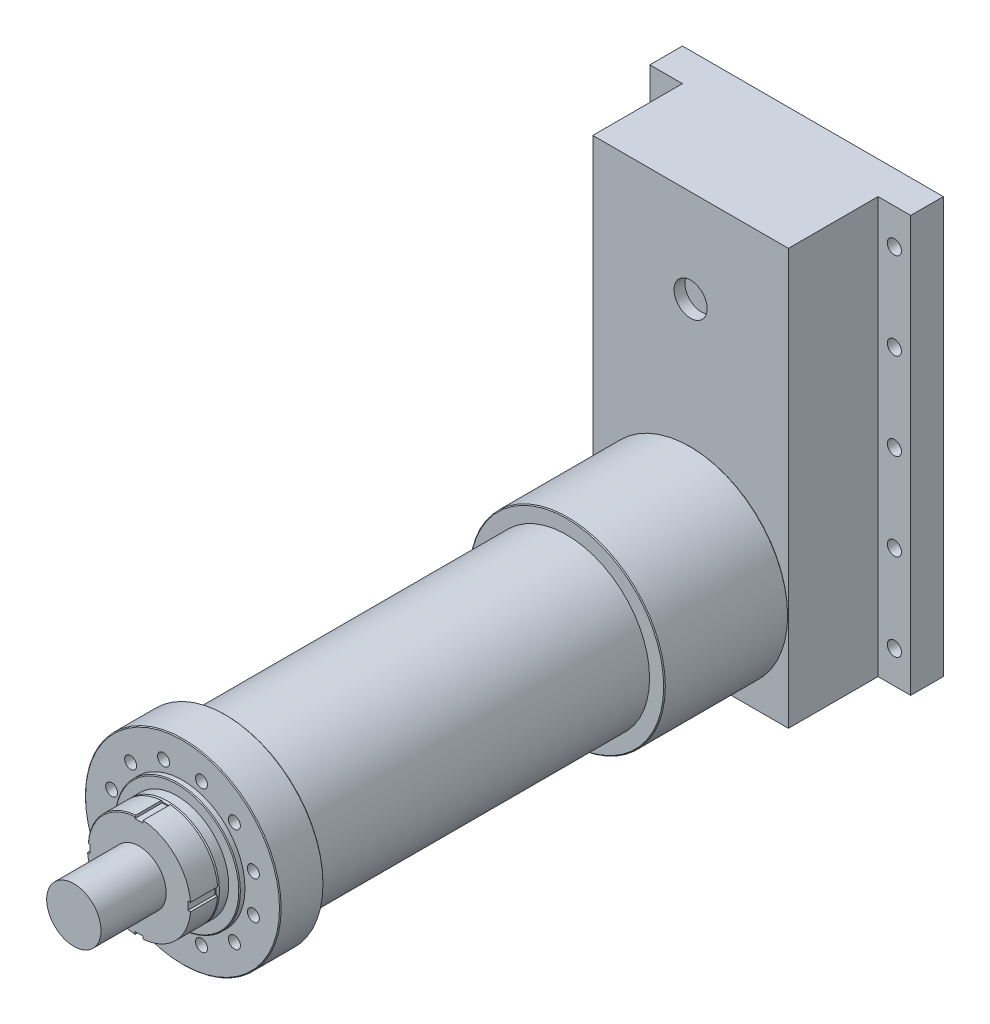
ISO-10303-21;
HEADER;
FILE_DESCRIPTION(('STEP AP214'),'2;1');
FILE_NAME('part.step','',(''),(''),'','','');
FILE_SCHEMA(('AUTOMOTIVE_DESIGN { 1 0 10303 214 1 1 1 1 }'));
ENDSEC;
DATA;
#1=APPLICATION_CONTEXT('core data for automotive mechanical design processes');
#2=APPLICATION_PROTOCOL_DEFINITION('international standard','automotive_design',2000,#1);
#3=PRODUCT_CONTEXT('',#1,'mechanical');
#4=PRODUCT('Part','Part','',(#3));
#5=PRODUCT_RELATED_PRODUCT_CATEGORY('part','',(#4));
#6=PRODUCT_DEFINITION_FORMATION('','',#4);
#7=PRODUCT_DEFINITION_CONTEXT('part definition',#1,'design');
#8=PRODUCT_DEFINITION('design','',#6,#7);
#9=PRODUCT_DEFINITION_SHAPE('','',#8);
#10=(LENGTH_UNIT() NAMED_UNIT(*) SI_UNIT(.MILLI.,.METRE.));
#11=(NAMED_UNIT(*) PLANE_ANGLE_UNIT() SI_UNIT($,.RADIAN.));
#12=(NAMED_UNIT(*) SI_UNIT($,.STERADIAN.) SOLID_ANGLE_UNIT());
#13=UNCERTAINTY_MEASURE_WITH_UNIT(LENGTH_MEASURE(1.E-05),#10,'distance_accuracy_value','');
#14=(GEOMETRIC_REPRESENTATION_CONTEXT(3) GLOBAL_UNCERTAINTY_ASSIGNED_CONTEXT((#13)) GLOBAL_UNIT_ASSIGNED_CONTEXT((#10,
#11,#12)) REPRESENTATION_CONTEXT('',''));
#15=CARTESIAN_POINT('',(0.,0.,0.));
#16=DIRECTION('',(0.,0.,1.));
#17=DIRECTION('',(1.,0.,0.));
#18=AXIS2_PLACEMENT_3D('',#15,#16,#17);
#19=CARTESIAN_POINT('',(0.,-180.,-393.));
#20=DIRECTION('',(0.,1.,0.));
#21=DIRECTION('',(0.,0.,1.));
#22=AXIS2_PLACEMENT_3D('',#19,#20,#21);
#23=PLANE('',#22);
#24=DIRECTION('',(-1.,0.,0.));
#25=VECTOR('',#24,1.);
#26=CARTESIAN_POINT('',(0.,-180.,-228.));
#27=LINE('',#26,#25);
#28=CARTESIAN_POINT('',(180.,-180.,-228.));
#29=VERTEX_POINT('',#28);
#30=CARTESIAN_POINT('',(-180.,-180.,-228.));
#31=VERTEX_POINT('',#30);
#32=EDGE_CURVE('E155',#29,#31,#27,.T.);
#33=ORIENTED_EDGE('',*,*,#32,.T.);
#34=DIRECTION('',(0.,0.,1.));
#35=VECTOR('',#34,1.);
#36=CARTESIAN_POINT('',(-180.,-180.,-393.));
#37=LINE('',#36,#35);
#38=CARTESIAN_POINT('',(-180.,-180.,-393.));
#39=VERTEX_POINT('',#38);
#40=EDGE_CURVE('E12',#39,#31,#37,.T.);
#41=ORIENTED_EDGE('',*,*,#40,.F.);
#42=DIRECTION('',(-1.,0.,0.));
#43=VECTOR('',#42,1.);
#44=CARTESIAN_POINT('',(240.,-180.,-393.));
#45=LINE('',#44,#43);
#46=CARTESIAN_POINT('',(-240.,-180.,-393.));
#47=VERTEX_POINT('',#46);
#48=EDGE_CURVE('E195',#39,#47,#45,.T.);
#49=ORIENTED_EDGE('',*,*,#48,.T.);
#50=DIRECTION('',(0.,0.,1.));
#51=VECTOR('',#50,1.);
#52=CARTESIAN_POINT('',(-240.,-180.,-453.));
#53=LINE('',#52,#51);
#54=CARTESIAN_POINT('',(-240.,-180.,-453.));
#55=VERTEX_POINT('',#54);
#56=EDGE_CURVE('E197',#55,#47,#53,.T.);
#57=ORIENTED_EDGE('',*,*,#56,.F.);
#58=DIRECTION('',(-1.,0.,0.));
#59=VECTOR('',#58,1.);
#60=CARTESIAN_POINT('',(240.,-180.,-453.));
#61=LINE('',#60,#59);
#62=CARTESIAN_POINT('',(240.,-180.,-453.));
#63=VERTEX_POINT('',#62);
#64=EDGE_CURVE('E136',#63,#55,#61,.T.);
#65=ORIENTED_EDGE('',*,*,#64,.F.);
#66=DIRECTION('',(0.,0.,1.));
#67=VECTOR('',#66,1.);
#68=CARTESIAN_POINT('',(240.,-180.,-453.));
#69=LINE('',#68,#67);
#70=CARTESIAN_POINT('',(240.,-180.,-393.));
#71=VERTEX_POINT('',#70);
#72=EDGE_CURVE('E150',#63,#71,#69,.T.);
#73=ORIENTED_EDGE('',*,*,#72,.T.);
#74=CARTESIAN_POINT('',(180.,-180.,-393.));
#75=VERTEX_POINT('',#74);
#76=EDGE_CURVE('E140',#71,#75,#45,.T.);
#77=ORIENTED_EDGE('',*,*,#76,.T.);
#78=DIRECTION('',(0.,0.,1.));
#79=VECTOR('',#78,1.);
#80=CARTESIAN_POINT('',(180.,-180.,-393.));
#81=LINE('',#80,#79);
#82=EDGE_CURVE('E161',#75,#29,#81,.T.);
#83=ORIENTED_EDGE('',*,*,#82,.T.);
#84=EDGE_LOOP('',(#33,#41,#49,#57,#65,#73,#77,#83));
#85=FACE_BOUND('',#84,.T.);
#86=ADVANCED_FACE('F51',(#85),#23,.F.);
#87=CARTESIAN_POINT('',(-180.,0.,-393.));
#88=DIRECTION('',(1.,0.,0.));
#89=DIRECTION('',(0.,0.,-1.));
#90=AXIS2_PLACEMENT_3D('',#87,#88,#89);
#91=PLANE('',#90);
#92=DIRECTION('',(0.,1.,0.));
#93=VECTOR('',#92,1.);
#94=CARTESIAN_POINT('',(-180.,0.,-228.));
#95=LINE('',#94,#93);
#96=CARTESIAN_POINT('',(-180.,585.,-228.));
#97=VERTEX_POINT('',#96);
#98=EDGE_CURVE('E164',#31,#97,#95,.T.);
#99=ORIENTED_EDGE('',*,*,#98,.T.);
#100=DIRECTION('',(0.,0.,1.));
#101=VECTOR('',#100,1.);
#102=CARTESIAN_POINT('',(-180.,585.,-393.));
#103=LINE('',#102,#101);
#104=CARTESIAN_POINT('',(-180.,585.,-393.));
#105=VERTEX_POINT('',#104);
#106=EDGE_CURVE('E59',#105,#97,#103,.T.);
#107=ORIENTED_EDGE('',*,*,#106,.F.);
#108=DIRECTION('',(0.,1.,0.));
#109=VECTOR('',#108,1.);
#110=CARTESIAN_POINT('',(-180.,0.,-393.));
#111=LINE('',#110,#109);
#112=EDGE_CURVE('E90',#39,#105,#111,.T.);
#113=ORIENTED_EDGE('',*,*,#112,.F.);
#114=ORIENTED_EDGE('',*,*,#40,.T.);
#115=EDGE_LOOP('',(#99,#107,#113,#114));
#116=FACE_BOUND('',#115,.T.);
#117=ADVANCED_FACE('F173',(#116),#91,.F.);
#118=CARTESIAN_POINT('',(0.,585.,-393.));
#119=DIRECTION('',(0.,1.,0.));
#120=DIRECTION('',(0.,0.,1.));
#121=AXIS2_PLACEMENT_3D('',#118,#119,#120);
#122=PLANE('',#121);
#123=DIRECTION('',(-1.,0.,0.));
#124=VECTOR('',#123,1.);
#125=CARTESIAN_POINT('',(0.,585.,-228.));
#126=LINE('',#125,#124);
#127=CARTESIAN_POINT('',(180.,585.,-228.));
#128=VERTEX_POINT('',#127);
#129=EDGE_CURVE('E167',#128,#97,#126,.T.);
#130=ORIENTED_EDGE('',*,*,#129,.F.);
#131=DIRECTION('',(0.,0.,1.));
#132=VECTOR('',#131,1.);
#133=CARTESIAN_POINT('',(180.,585.,-393.));
#134=LINE('',#133,#132);
#135=CARTESIAN_POINT('',(180.,585.,-393.));
#136=VERTEX_POINT('',#135);
#137=EDGE_CURVE('E67',#136,#128,#134,.T.);
#138=ORIENTED_EDGE('',*,*,#137,.F.);
#139=DIRECTION('',(1.,0.,0.));
#140=VECTOR('',#139,1.);
#141=CARTESIAN_POINT('',(240.,585.,-393.));
#142=LINE('',#141,#140);
#143=CARTESIAN_POINT('',(240.,585.,-393.));
#144=VERTEX_POINT('',#143);
#145=EDGE_CURVE('E187',#136,#144,#142,.T.);
#146=ORIENTED_EDGE('',*,*,#145,.T.);
#147=DIRECTION('',(0.,0.,1.));
#148=VECTOR('',#147,1.);
#149=CARTESIAN_POINT('',(240.,585.,-453.));
#150=LINE('',#149,#148);
#151=CARTESIAN_POINT('',(240.,585.,-453.));
#152=VERTEX_POINT('',#151);
#153=EDGE_CURVE('E126',#152,#144,#150,.T.);
#154=ORIENTED_EDGE('',*,*,#153,.F.);
#155=DIRECTION('',(1.,0.,0.));
#156=VECTOR('',#155,1.);
#157=CARTESIAN_POINT('',(240.,585.,-453.));
#158=LINE('',#157,#156);
#159=CARTESIAN_POINT('',(-240.,585.,-453.));
#160=VERTEX_POINT('',#159);
#161=EDGE_CURVE('E118',#160,#152,#158,.T.);
#162=ORIENTED_EDGE('',*,*,#161,.F.);
#163=DIRECTION('',(0.,0.,1.));
#164=VECTOR('',#163,1.);
#165=CARTESIAN_POINT('',(-240.,585.,-453.));
#166=LINE('',#165,#164);
#167=CARTESIAN_POINT('',(-240.,585.,-393.));
#168=VERTEX_POINT('',#167);
#169=EDGE_CURVE('E123',#160,#168,#166,.T.);
#170=ORIENTED_EDGE('',*,*,#169,.T.);
#171=EDGE_CURVE('E172',#168,#105,#142,.T.);
#172=ORIENTED_EDGE('',*,*,#171,.T.);
#173=ORIENTED_EDGE('',*,*,#106,.T.);
#174=EDGE_LOOP('',(#130,#138,#146,#154,#162,#170,#172,#173));
#175=FACE_BOUND('',#174,.T.);
#176=ADVANCED_FACE('F120',(#175),#122,.T.);
#177=CARTESIAN_POINT('',(180.,0.,-393.));
#178=DIRECTION('',(-1.,0.,0.));
#179=DIRECTION('',(0.,0.,1.));
#180=AXIS2_PLACEMENT_3D('',#177,#178,#179);
#181=PLANE('',#180);
#182=DIRECTION('',(0.,-1.,0.));
#183=VECTOR('',#182,1.);
#184=CARTESIAN_POINT('',(180.,0.,-228.));
#185=LINE('',#184,#183);
#186=EDGE_CURVE('E85',#128,#29,#185,.T.);
#187=ORIENTED_EDGE('',*,*,#186,.T.);
#188=ORIENTED_EDGE('',*,*,#82,.F.);
#189=DIRECTION('',(0.,-1.,0.));
#190=VECTOR('',#189,1.);
#191=CARTESIAN_POINT('',(180.,0.,-393.));
#192=LINE('',#191,#190);
#193=EDGE_CURVE('E158',#136,#75,#192,.T.);
#194=ORIENTED_EDGE('',*,*,#193,.F.);
#195=ORIENTED_EDGE('',*,*,#137,.T.);
#196=EDGE_LOOP('',(#187,#188,#194,#195));
#197=FACE_BOUND('',#196,.T.);
#198=ADVANCED_FACE('F182',(#197),#181,.F.);
#199=CARTESIAN_POINT('',(0.,0.,-228.));
#200=DIRECTION('',(0.,0.,-1.));
#201=DIRECTION('',(-1.,0.,0.));
#202=AXIS2_PLACEMENT_3D('',#199,#200,#201);
#203=PLANE('',#202);
#204=CARTESIAN_POINT('',(0.,414.,-228.));
#205=DIRECTION('',(0.,0.,1.));
#206=DIRECTION('',(1.,0.,0.));
#207=AXIS2_PLACEMENT_3D('',#204,#205,#206);
#208=CIRCLE('',#207,30.4407465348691);
#209=CARTESIAN_POINT('',(30.4407465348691,414.,-228.));
#210=VERTEX_POINT('',#209);
#211=EDGE_CURVE('E145',#210,#210,#208,.T.);
#212=ORIENTED_EDGE('',*,*,#211,.F.);
#213=EDGE_LOOP('',(#212));
#214=FACE_BOUND('',#213,.T.);
#215=ORIENTED_EDGE('',*,*,#32,.F.);
#216=ORIENTED_EDGE('',*,*,#186,.F.);
#217=ORIENTED_EDGE('',*,*,#129,.T.);
#218=ORIENTED_EDGE('',*,*,#98,.F.);
#219=EDGE_LOOP('',(#215,#216,#217,#218));
#220=FACE_BOUND('',#219,.T.);
#221=ADVANCED_FACE('F176',(#214,#220),#203,.F.);
#222=CARTESIAN_POINT('',(0.,414.,-248.));
#223=DIRECTION('',(0.,0.,1.));
#224=DIRECTION('',(1.,0.,0.));
#225=AXIS2_PLACEMENT_3D('',#222,#223,#224);
#226=CYLINDRICAL_SURFACE('',#225,30.4407465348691);
#227=CARTESIAN_POINT('',(0.,414.,-248.));
#228=DIRECTION('',(0.,0.,1.));
#229=DIRECTION('',(1.,0.,0.));
#230=AXIS2_PLACEMENT_3D('',#227,#228,#229);
#231=CIRCLE('',#230,30.4407465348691);
#232=CARTESIAN_POINT('',(30.4407465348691,414.,-248.));
#233=VERTEX_POINT('',#232);
#234=EDGE_CURVE('E148',#233,#233,#231,.T.);
#235=ORIENTED_EDGE('',*,*,#234,.F.);
#236=EDGE_LOOP('',(#235));
#237=FACE_BOUND('',#236,.T.);
#238=ORIENTED_EDGE('',*,*,#211,.T.);
#239=EDGE_LOOP('',(#238));
#240=FACE_BOUND('',#239,.T.);
#241=ADVANCED_FACE('F293',(#237,#240),#226,.F.);
#242=CARTESIAN_POINT('',(0.,414.,-248.));
#243=DIRECTION('',(0.,0.,1.));
#244=DIRECTION('',(1.,0.,0.));
#245=AXIS2_PLACEMENT_3D('',#242,#243,#244);
#246=PLANE('',#245);
#247=ORIENTED_EDGE('',*,*,#234,.T.);
#248=EDGE_LOOP('',(#247));
#249=FACE_BOUND('',#248,.T.);
#250=ADVANCED_FACE('F297',(#249),#246,.T.);
#251=CARTESIAN_POINT('',(0.,0.,-393.));
#252=DIRECTION('',(0.,0.,-1.));
#253=DIRECTION('',(-1.,0.,0.));
#254=AXIS2_PLACEMENT_3D('',#251,#252,#253);
#255=PLANE('',#254);
#256=CARTESIAN_POINT('',(-210.,-120.,-393.));
#257=DIRECTION('',(0.,0.,-1.));
#258=DIRECTION('',(1.,0.,0.));
#259=AXIS2_PLACEMENT_3D('',#256,#257,#258);
#260=CIRCLE('',#259,13.);
#261=CARTESIAN_POINT('',(-197.,-120.,-393.));
#262=VERTEX_POINT('',#261);
#263=EDGE_CURVE('E233',#262,#262,#260,.T.);
#264=ORIENTED_EDGE('',*,*,#263,.T.);
#265=EDGE_LOOP('',(#264));
#266=FACE_BOUND('',#265,.T.);
#267=CARTESIAN_POINT('',(-210.,39.9999999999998,-393.));
#268=DIRECTION('',(0.,0.,-1.));
#269=DIRECTION('',(1.,0.,0.));
#270=AXIS2_PLACEMENT_3D('',#267,#268,#269);
#271=CIRCLE('',#270,13.);
#272=CARTESIAN_POINT('',(-197.,39.9999999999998,-393.));
#273=VERTEX_POINT('',#272);
#274=EDGE_CURVE('E239',#273,#273,#271,.T.);
#275=ORIENTED_EDGE('',*,*,#274,.T.);
#276=EDGE_LOOP('',(#275));
#277=FACE_BOUND('',#276,.T.);
#278=CARTESIAN_POINT('',(-210.,200.,-393.));
#279=DIRECTION('',(0.,0.,-1.));
#280=DIRECTION('',(1.,0.,0.));
#281=AXIS2_PLACEMENT_3D('',#278,#279,#280);
#282=CIRCLE('',#281,13.);
#283=CARTESIAN_POINT('',(-197.,200.,-393.));
#284=VERTEX_POINT('',#283);
#285=EDGE_CURVE('E245',#284,#284,#282,.T.);
#286=ORIENTED_EDGE('',*,*,#285,.T.);
#287=EDGE_LOOP('',(#286));
#288=FACE_BOUND('',#287,.T.);
#289=CARTESIAN_POINT('',(-210.,360.,-393.));
#290=DIRECTION('',(0.,0.,-1.));
#291=DIRECTION('',(1.,0.,0.));
#292=AXIS2_PLACEMENT_3D('',#289,#290,#291);
#293=CIRCLE('',#292,13.);
#294=CARTESIAN_POINT('',(-197.,360.,-393.));
#295=VERTEX_POINT('',#294);
#296=EDGE_CURVE('E251',#295,#295,#293,.T.);
#297=ORIENTED_EDGE('',*,*,#296,.T.);
#298=EDGE_LOOP('',(#297));
#299=FACE_BOUND('',#298,.T.);
#300=CARTESIAN_POINT('',(-210.,520.,-393.));
#301=DIRECTION('',(0.,0.,-1.));
#302=DIRECTION('',(1.,0.,0.));
#303=AXIS2_PLACEMENT_3D('',#300,#301,#302);
#304=CIRCLE('',#303,13.);
#305=CARTESIAN_POINT('',(-197.,520.,-393.));
#306=VERTEX_POINT('',#305);
#307=EDGE_CURVE('E257',#306,#306,#304,.T.);
#308=ORIENTED_EDGE('',*,*,#307,.T.);
#309=EDGE_LOOP('',(#308));
#310=FACE_BOUND('',#309,.T.);
#311=ORIENTED_EDGE('',*,*,#48,.F.);
#312=ORIENTED_EDGE('',*,*,#112,.T.);
#313=ORIENTED_EDGE('',*,*,#171,.F.);
#314=DIRECTION('',(0.,1.,0.));
#315=VECTOR('',#314,1.);
#316=CARTESIAN_POINT('',(-240.,585.,-393.));
#317=LINE('',#316,#315);
#318=EDGE_CURVE('E144',#47,#168,#317,.T.);
#319=ORIENTED_EDGE('',*,*,#318,.F.);
#320=EDGE_LOOP('',(#311,#312,#313,#319));
#321=FACE_BOUND('',#320,.T.);
#322=ADVANCED_FACE('F274',(#266,#277,#288,#299,#310,#321),#255,.F.);
#323=CARTESIAN_POINT('',(210.,-120.,-393.));
#324=DIRECTION('',(0.,0.,-1.));
#325=DIRECTION('',(-1.,0.,0.));
#326=AXIS2_PLACEMENT_3D('',#323,#324,#325);
#327=CIRCLE('',#326,13.);
#328=CARTESIAN_POINT('',(197.,-120.,-393.));
#329=VERTEX_POINT('',#328);
#330=EDGE_CURVE('E227',#329,#329,#327,.T.);
#331=ORIENTED_EDGE('',*,*,#330,.T.);
#332=EDGE_LOOP('',(#331));
#333=FACE_BOUND('',#332,.T.);
#334=CARTESIAN_POINT('',(210.,40.0000000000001,-393.));
#335=DIRECTION('',(0.,0.,-1.));
#336=DIRECTION('',(-1.,0.,0.));
#337=AXIS2_PLACEMENT_3D('',#334,#335,#336);
#338=CIRCLE('',#337,13.);
#339=CARTESIAN_POINT('',(197.,40.0000000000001,-393.));
#340=VERTEX_POINT('',#339);
#341=EDGE_CURVE('E221',#340,#340,#338,.T.);
#342=ORIENTED_EDGE('',*,*,#341,.T.);
#343=EDGE_LOOP('',(#342));
#344=FACE_BOUND('',#343,.T.);
#345=CARTESIAN_POINT('',(210.,200.,-393.));
#346=DIRECTION('',(0.,0.,-1.));
#347=DIRECTION('',(-1.,0.,0.));
#348=AXIS2_PLACEMENT_3D('',#345,#346,#347);
#349=CIRCLE('',#348,13.);
#350=CARTESIAN_POINT('',(197.,200.,-393.));
#351=VERTEX_POINT('',#350);
#352=EDGE_CURVE('E215',#351,#351,#349,.T.);
#353=ORIENTED_EDGE('',*,*,#352,.T.);
#354=EDGE_LOOP('',(#353));
#355=FACE_BOUND('',#354,.T.);
#356=CARTESIAN_POINT('',(210.,360.,-393.));
#357=DIRECTION('',(0.,0.,-1.));
#358=DIRECTION('',(-1.,0.,0.));
#359=AXIS2_PLACEMENT_3D('',#356,#357,#358);
#360=CIRCLE('',#359,13.);
#361=CARTESIAN_POINT('',(197.,360.,-393.));
#362=VERTEX_POINT('',#361);
#363=EDGE_CURVE('E209',#362,#362,#360,.T.);
#364=ORIENTED_EDGE('',*,*,#363,.T.);
#365=EDGE_LOOP('',(#364));
#366=FACE_BOUND('',#365,.T.);
#367=CARTESIAN_POINT('',(210.,520.,-393.));
#368=DIRECTION('',(0.,0.,-1.));
#369=DIRECTION('',(-1.,0.,0.));
#370=AXIS2_PLACEMENT_3D('',#367,#368,#369);
#371=CIRCLE('',#370,13.);
#372=CARTESIAN_POINT('',(197.,520.,-393.));
#373=VERTEX_POINT('',#372);
#374=EDGE_CURVE('E203',#373,#373,#371,.T.);
#375=ORIENTED_EDGE('',*,*,#374,.T.);
#376=EDGE_LOOP('',(#375));
#377=FACE_BOUND('',#376,.T.);
#378=ORIENTED_EDGE('',*,*,#145,.F.);
#379=ORIENTED_EDGE('',*,*,#193,.T.);
#380=ORIENTED_EDGE('',*,*,#76,.F.);
#381=DIRECTION('',(0.,-1.,0.));
#382=VECTOR('',#381,1.);
#383=CARTESIAN_POINT('',(240.,585.,-393.));
#384=LINE('',#383,#382);
#385=EDGE_CURVE('E188',#144,#71,#384,.T.);
#386=ORIENTED_EDGE('',*,*,#385,.F.);
#387=EDGE_LOOP('',(#378,#379,#380,#386));
#388=FACE_BOUND('',#387,.T.);
#389=ADVANCED_FACE('F185',(#333,#344,#355,#366,#377,#388),#255,.F.);
#390=CARTESIAN_POINT('',(0.,0.,-453.));
#391=DIRECTION('',(0.,0.,-1.));
#392=DIRECTION('',(-1.,0.,0.));
#393=AXIS2_PLACEMENT_3D('',#390,#391,#392);
#394=PLANE('',#393);
#395=CARTESIAN_POINT('',(-210.,360.,-453.));
#396=DIRECTION('',(0.,0.,-1.));
#397=DIRECTION('',(1.,0.,0.));
#398=AXIS2_PLACEMENT_3D('',#395,#396,#397);
#399=CIRCLE('',#398,13.);
#400=CARTESIAN_POINT('',(-197.,360.,-453.));
#401=VERTEX_POINT('',#400);
#402=EDGE_CURVE('E248',#401,#401,#399,.T.);
#403=ORIENTED_EDGE('',*,*,#402,.F.);
#404=EDGE_LOOP('',(#403));
#405=FACE_BOUND('',#404,.T.);
#406=CARTESIAN_POINT('',(-210.,39.9999999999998,-453.));
#407=DIRECTION('',(0.,0.,-1.));
#408=DIRECTION('',(1.,0.,0.));
#409=AXIS2_PLACEMENT_3D('',#406,#407,#408);
#410=CIRCLE('',#409,13.);
#411=CARTESIAN_POINT('',(-197.,39.9999999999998,-453.));
#412=VERTEX_POINT('',#411);
#413=EDGE_CURVE('E236',#412,#412,#410,.T.);
#414=ORIENTED_EDGE('',*,*,#413,.F.);
#415=EDGE_LOOP('',(#414));
#416=FACE_BOUND('',#415,.T.);
#417=CARTESIAN_POINT('',(210.,-120.,-453.));
#418=DIRECTION('',(0.,0.,-1.));
#419=DIRECTION('',(-1.,0.,0.));
#420=AXIS2_PLACEMENT_3D('',#417,#418,#419);
#421=CIRCLE('',#420,13.);
#422=CARTESIAN_POINT('',(197.,-120.,-453.));
#423=VERTEX_POINT('',#422);
#424=EDGE_CURVE('E224',#423,#423,#421,.T.);
#425=ORIENTED_EDGE('',*,*,#424,.F.);
#426=EDGE_LOOP('',(#425));
#427=FACE_BOUND('',#426,.T.);
#428=CARTESIAN_POINT('',(210.,200.,-453.));
#429=DIRECTION('',(0.,0.,-1.));
#430=DIRECTION('',(-1.,0.,0.));
#431=AXIS2_PLACEMENT_3D('',#428,#429,#430);
#432=CIRCLE('',#431,13.);
#433=CARTESIAN_POINT('',(197.,200.,-453.));
#434=VERTEX_POINT('',#433);
#435=EDGE_CURVE('E212',#434,#434,#432,.T.);
#436=ORIENTED_EDGE('',*,*,#435,.F.);
#437=EDGE_LOOP('',(#436));
#438=FACE_BOUND('',#437,.T.);
#439=CARTESIAN_POINT('',(210.,520.,-453.));
#440=DIRECTION('',(0.,0.,-1.));
#441=DIRECTION('',(-1.,0.,0.));
#442=AXIS2_PLACEMENT_3D('',#439,#440,#441);
#443=CIRCLE('',#442,13.);
#444=CARTESIAN_POINT('',(197.,520.,-453.));
#445=VERTEX_POINT('',#444);
#446=EDGE_CURVE('E190',#445,#445,#443,.T.);
#447=ORIENTED_EDGE('',*,*,#446,.F.);
#448=EDGE_LOOP('',(#447));
#449=FACE_BOUND('',#448,.T.);
#450=DIRECTION('',(0.,1.,0.));
#451=VECTOR('',#450,1.);
#452=CARTESIAN_POINT('',(-240.,585.,-453.));
#453=LINE('',#452,#451);
#454=EDGE_CURVE('E130',#55,#160,#453,.T.);
#455=ORIENTED_EDGE('',*,*,#454,.T.);
#456=ORIENTED_EDGE('',*,*,#161,.T.);
#457=DIRECTION('',(0.,-1.,0.));
#458=VECTOR('',#457,1.);
#459=CARTESIAN_POINT('',(240.,585.,-453.));
#460=LINE('',#459,#458);
#461=EDGE_CURVE('E129',#152,#63,#460,.T.);
#462=ORIENTED_EDGE('',*,*,#461,.T.);
#463=ORIENTED_EDGE('',*,*,#64,.T.);
#464=EDGE_LOOP('',(#455,#456,#462,#463));
#465=FACE_BOUND('',#464,.T.);
#466=CARTESIAN_POINT('',(210.,360.,-453.));
#467=DIRECTION('',(0.,0.,-1.));
#468=DIRECTION('',(-1.,0.,0.));
#469=AXIS2_PLACEMENT_3D('',#466,#467,#468);
#470=CIRCLE('',#469,13.);
#471=CARTESIAN_POINT('',(197.,360.,-453.));
#472=VERTEX_POINT('',#471);
#473=EDGE_CURVE('E206',#472,#472,#470,.T.);
#474=ORIENTED_EDGE('',*,*,#473,.F.);
#475=EDGE_LOOP('',(#474));
#476=FACE_BOUND('',#475,.T.);
#477=CARTESIAN_POINT('',(210.,40.0000000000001,-453.));
#478=DIRECTION('',(0.,0.,-1.));
#479=DIRECTION('',(-1.,0.,0.));
#480=AXIS2_PLACEMENT_3D('',#477,#478,#479);
#481=CIRCLE('',#480,13.);
#482=CARTESIAN_POINT('',(197.,40.0000000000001,-453.));
#483=VERTEX_POINT('',#482);
#484=EDGE_CURVE('E218',#483,#483,#481,.T.);
#485=ORIENTED_EDGE('',*,*,#484,.F.);
#486=EDGE_LOOP('',(#485));
#487=FACE_BOUND('',#486,.T.);
#488=CARTESIAN_POINT('',(-210.,-120.,-453.));
#489=DIRECTION('',(0.,0.,-1.));
#490=DIRECTION('',(1.,0.,0.));
#491=AXIS2_PLACEMENT_3D('',#488,#489,#490);
#492=CIRCLE('',#491,13.);
#493=CARTESIAN_POINT('',(-197.,-120.,-453.));
#494=VERTEX_POINT('',#493);
#495=EDGE_CURVE('E230',#494,#494,#492,.T.);
#496=ORIENTED_EDGE('',*,*,#495,.F.);
#497=EDGE_LOOP('',(#496));
#498=FACE_BOUND('',#497,.T.);
#499=CARTESIAN_POINT('',(-210.,200.,-453.));
#500=DIRECTION('',(0.,0.,-1.));
#501=DIRECTION('',(1.,0.,0.));
#502=AXIS2_PLACEMENT_3D('',#499,#500,#501);
#503=CIRCLE('',#502,13.);
#504=CARTESIAN_POINT('',(-197.,200.,-453.));
#505=VERTEX_POINT('',#504);
#506=EDGE_CURVE('E242',#505,#505,#503,.T.);
#507=ORIENTED_EDGE('',*,*,#506,.F.);
#508=EDGE_LOOP('',(#507));
#509=FACE_BOUND('',#508,.T.);
#510=CARTESIAN_POINT('',(-210.,520.,-453.));
#511=DIRECTION('',(0.,0.,-1.));
#512=DIRECTION('',(1.,0.,0.));
#513=AXIS2_PLACEMENT_3D('',#510,#511,#512);
#514=CIRCLE('',#513,13.);
#515=CARTESIAN_POINT('',(-197.,520.,-453.));
#516=VERTEX_POINT('',#515);
#517=EDGE_CURVE('E254',#516,#516,#514,.T.);
#518=ORIENTED_EDGE('',*,*,#517,.F.);
#519=EDGE_LOOP('',(#518));
#520=FACE_BOUND('',#519,.T.);
#521=ADVANCED_FACE('F133',(#405,#416,#427,#438,#449,#465,#476,#487,#498,#509,#520),#394,.T.);
#522=CARTESIAN_POINT('',(-240.,585.,-453.));
#523=DIRECTION('',(1.,0.,0.));
#524=DIRECTION('',(0.,0.,-1.));
#525=AXIS2_PLACEMENT_3D('',#522,#523,#524);
#526=PLANE('',#525);
#527=ORIENTED_EDGE('',*,*,#318,.T.);
#528=ORIENTED_EDGE('',*,*,#169,.F.);
#529=ORIENTED_EDGE('',*,*,#454,.F.);
#530=ORIENTED_EDGE('',*,*,#56,.T.);
#531=EDGE_LOOP('',(#527,#528,#529,#530));
#532=FACE_BOUND('',#531,.T.);
#533=ADVANCED_FACE('F142',(#532),#526,.F.);
#534=CARTESIAN_POINT('',(240.,585.,-453.));
#535=DIRECTION('',(-1.,0.,0.));
#536=DIRECTION('',(0.,0.,1.));
#537=AXIS2_PLACEMENT_3D('',#534,#535,#536);
#538=PLANE('',#537);
#539=ORIENTED_EDGE('',*,*,#385,.T.);
#540=ORIENTED_EDGE('',*,*,#72,.F.);
#541=ORIENTED_EDGE('',*,*,#461,.F.);
#542=ORIENTED_EDGE('',*,*,#153,.T.);
#543=EDGE_LOOP('',(#539,#540,#541,#542));
#544=FACE_BOUND('',#543,.T.);
#545=ADVANCED_FACE('F200',(#544),#538,.F.);
#546=CARTESIAN_POINT('',(210.,520.,-453.));
#547=DIRECTION('',(0.,0.,1.));
#548=DIRECTION('',(1.,0.,0.));
#549=AXIS2_PLACEMENT_3D('',#546,#547,#548);
#550=CYLINDRICAL_SURFACE('',#549,13.);
#551=ORIENTED_EDGE('',*,*,#446,.T.);
#552=EDGE_LOOP('',(#551));
#553=FACE_BOUND('',#552,.T.);
#554=ORIENTED_EDGE('',*,*,#374,.F.);
#555=EDGE_LOOP('',(#554));
#556=FACE_BOUND('',#555,.T.);
#557=ADVANCED_FACE('F303',(#553,#556),#550,.F.);
#558=CARTESIAN_POINT('',(210.,360.,-453.));
#559=DIRECTION('',(0.,0.,1.));
#560=DIRECTION('',(1.,0.,0.));
#561=AXIS2_PLACEMENT_3D('',#558,#559,#560);
#562=CYLINDRICAL_SURFACE('',#561,13.);
#563=ORIENTED_EDGE('',*,*,#473,.T.);
#564=EDGE_LOOP('',(#563));
#565=FACE_BOUND('',#564,.T.);
#566=ORIENTED_EDGE('',*,*,#363,.F.);
#567=EDGE_LOOP('',(#566));
#568=FACE_BOUND('',#567,.T.);
#569=ADVANCED_FACE('F350',(#565,#568),#562,.F.);
#570=CARTESIAN_POINT('',(210.,200.,-453.));
#571=DIRECTION('',(0.,0.,1.));
#572=DIRECTION('',(1.,0.,0.));
#573=AXIS2_PLACEMENT_3D('',#570,#571,#572);
#574=CYLINDRICAL_SURFACE('',#573,13.);
#575=ORIENTED_EDGE('',*,*,#435,.T.);
#576=EDGE_LOOP('',(#575));
#577=FACE_BOUND('',#576,.T.);
#578=ORIENTED_EDGE('',*,*,#352,.F.);
#579=EDGE_LOOP('',(#578));
#580=FACE_BOUND('',#579,.T.);
#581=ADVANCED_FACE('F346',(#577,#580),#574,.F.);
#582=CARTESIAN_POINT('',(210.,40.0000000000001,-453.));
#583=DIRECTION('',(0.,0.,1.));
#584=DIRECTION('',(1.,0.,0.));
#585=AXIS2_PLACEMENT_3D('',#582,#583,#584);
#586=CYLINDRICAL_SURFACE('',#585,13.);
#587=ORIENTED_EDGE('',*,*,#484,.T.);
#588=EDGE_LOOP('',(#587));
#589=FACE_BOUND('',#588,.T.);
#590=ORIENTED_EDGE('',*,*,#341,.F.);
#591=EDGE_LOOP('',(#590));
#592=FACE_BOUND('',#591,.T.);
#593=ADVANCED_FACE('F342',(#589,#592),#586,.F.);
#594=CARTESIAN_POINT('',(210.,-120.,-453.));
#595=DIRECTION('',(0.,0.,1.));
#596=DIRECTION('',(1.,0.,0.));
#597=AXIS2_PLACEMENT_3D('',#594,#595,#596);
#598=CYLINDRICAL_SURFACE('',#597,13.);
#599=ORIENTED_EDGE('',*,*,#424,.T.);
#600=EDGE_LOOP('',(#599));
#601=FACE_BOUND('',#600,.T.);
#602=ORIENTED_EDGE('',*,*,#330,.F.);
#603=EDGE_LOOP('',(#602));
#604=FACE_BOUND('',#603,.T.);
#605=ADVANCED_FACE('F338',(#601,#604),#598,.F.);
#606=CARTESIAN_POINT('',(-210.,-120.,-453.));
#607=DIRECTION('',(0.,0.,1.));
#608=DIRECTION('',(1.,0.,0.));
#609=AXIS2_PLACEMENT_3D('',#606,#607,#608);
#610=CYLINDRICAL_SURFACE('',#609,13.);
#611=ORIENTED_EDGE('',*,*,#495,.T.);
#612=EDGE_LOOP('',(#611));
#613=FACE_BOUND('',#612,.T.);
#614=ORIENTED_EDGE('',*,*,#263,.F.);
#615=EDGE_LOOP('',(#614));
#616=FACE_BOUND('',#615,.T.);
#617=ADVANCED_FACE('F334',(#613,#616),#610,.F.);
#618=CARTESIAN_POINT('',(-210.,39.9999999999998,-453.));
#619=DIRECTION('',(0.,0.,1.));
#620=DIRECTION('',(1.,0.,0.));
#621=AXIS2_PLACEMENT_3D('',#618,#619,#620);
#622=CYLINDRICAL_SURFACE('',#621,13.);
#623=ORIENTED_EDGE('',*,*,#413,.T.);
#624=EDGE_LOOP('',(#623));
#625=FACE_BOUND('',#624,.T.);
#626=ORIENTED_EDGE('',*,*,#274,.F.);
#627=EDGE_LOOP('',(#626));
#628=FACE_BOUND('',#627,.T.);
#629=ADVANCED_FACE('F330',(#625,#628),#622,.F.);
#630=CARTESIAN_POINT('',(-210.,200.,-453.));
#631=DIRECTION('',(0.,0.,1.));
#632=DIRECTION('',(1.,0.,0.));
#633=AXIS2_PLACEMENT_3D('',#630,#631,#632);
#634=CYLINDRICAL_SURFACE('',#633,13.);
#635=ORIENTED_EDGE('',*,*,#506,.T.);
#636=EDGE_LOOP('',(#635));
#637=FACE_BOUND('',#636,.T.);
#638=ORIENTED_EDGE('',*,*,#285,.F.);
#639=EDGE_LOOP('',(#638));
#640=FACE_BOUND('',#639,.T.);
#641=ADVANCED_FACE('F324',(#637,#640),#634,.F.);
#642=CARTESIAN_POINT('',(-210.,360.,-453.));
#643=DIRECTION('',(0.,0.,1.));
#644=DIRECTION('',(1.,0.,0.));
#645=AXIS2_PLACEMENT_3D('',#642,#643,#644);
#646=CYLINDRICAL_SURFACE('',#645,13.);
#647=ORIENTED_EDGE('',*,*,#402,.T.);
#648=EDGE_LOOP('',(#647));
#649=FACE_BOUND('',#648,.T.);
#650=ORIENTED_EDGE('',*,*,#296,.F.);
#651=EDGE_LOOP('',(#650));
#652=FACE_BOUND('',#651,.T.);
#653=ADVANCED_FACE('F319',(#649,#652),#646,.F.);
#654=CARTESIAN_POINT('',(-210.,520.,-453.));
#655=DIRECTION('',(0.,0.,1.));
#656=DIRECTION('',(1.,0.,0.));
#657=AXIS2_PLACEMENT_3D('',#654,#655,#656);
#658=CYLINDRICAL_SURFACE('',#657,13.);
#659=ORIENTED_EDGE('',*,*,#517,.T.);
#660=EDGE_LOOP('',(#659));
#661=FACE_BOUND('',#660,.T.);
#662=ORIENTED_EDGE('',*,*,#307,.F.);
#663=EDGE_LOOP('',(#662));
#664=FACE_BOUND('',#663,.T.);
#665=ADVANCED_FACE('F263',(#661,#664),#658,.F.);
#666=CLOSED_SHELL('',(#86,#117,#176,#198,#221,#241,#250,#322,#389,#521,#533,#545,#557,#569,#581,
#593,#605,#617,#629,#641,#653,#665));
#667=MANIFOLD_SOLID_BREP('B2',#666);
#668=CARTESIAN_POINT('',(0.,0.,627.));
#669=DIRECTION('',(0.,0.,-1.));
#670=DIRECTION('',(-1.,0.,0.));
#671=AXIS2_PLACEMENT_3D('',#668,#669,#670);
#672=CYLINDRICAL_SURFACE('',#671,152.5);
#673=CARTESIAN_POINT('',(0.,0.,627.));
#674=DIRECTION('',(0.,0.,1.));
#675=DIRECTION('',(1.,0.,0.));
#676=AXIS2_PLACEMENT_3D('',#673,#674,#675);
#677=CIRCLE('',#676,152.5);
#678=CARTESIAN_POINT('',(152.5,0.,627.));
#679=VERTEX_POINT('',#678);
#680=EDGE_CURVE('E751',#679,#679,#677,.T.);
#681=ORIENTED_EDGE('',*,*,#680,.F.);
#682=EDGE_LOOP('',(#681));
#683=FACE_BOUND('',#682,.T.);
#684=CARTESIAN_POINT('',(0.,0.,0.));
#685=DIRECTION('',(0.,0.,1.));
#686=DIRECTION('',(1.,0.,0.));
#687=AXIS2_PLACEMENT_3D('',#684,#685,#686);
#688=CIRCLE('',#687,152.5);
#689=CARTESIAN_POINT('',(152.5,0.,0.));
#690=VERTEX_POINT('',#689);
#691=EDGE_CURVE('E846',#690,#690,#688,.T.);
#692=ORIENTED_EDGE('',*,*,#691,.T.);
#693=EDGE_LOOP('',(#692));
#694=FACE_BOUND('',#693,.T.);
#695=CARTESIAN_POINT('',(-152.5,0.,567.5));
#696=CARTESIAN_POINT('',(-152.500001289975,0.448200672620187,567.500004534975));
#697=CARTESIAN_POINT('',(-152.49802011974,0.896332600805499,567.481160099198));
#698=CARTESIAN_POINT('',(-152.49015354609,1.7895422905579,567.405923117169));
#699=CARTESIAN_POINT('',(-152.48426721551,2.23461930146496,567.349521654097));
#700=CARTESIAN_POINT('',(-152.46874661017,3.11882436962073,567.19949799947));
#701=CARTESIAN_POINT('',(-152.459108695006,3.55794621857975,567.105839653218));
#702=CARTESIAN_POINT('',(-152.436358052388,4.42668632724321,566.881990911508));
#703=CARTESIAN_POINT('',(-152.423245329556,4.8563045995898,566.75180056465));
#704=CARTESIAN_POINT('',(-152.393924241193,5.70272636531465,566.455928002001));
#705=CARTESIAN_POINT('',(-152.377717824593,6.11953773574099,566.290268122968));
#706=CARTESIAN_POINT('',(-152.342659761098,6.93770102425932,565.924599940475));
#707=CARTESIAN_POINT('',(-152.323808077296,7.33905272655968,565.724591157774));
#708=CARTESIAN_POINT('',(-152.283993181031,8.12339897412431,565.291700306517));
#709=CARTESIAN_POINT('',(-152.263030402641,8.50639726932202,565.058824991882));
#710=CARTESIAN_POINT('',(-152.219577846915,9.25145377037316,564.561819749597));
#711=CARTESIAN_POINT('',(-152.197088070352,9.61351198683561,564.297689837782));
#712=CARTESIAN_POINT('',(-152.151130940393,10.3154013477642,563.739051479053));
#713=CARTESIAN_POINT('',(-152.127660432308,10.6551500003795,563.444439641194));
#714=CARTESIAN_POINT('',(-152.080478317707,11.3086456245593,562.82768277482));
#715=CARTESIAN_POINT('',(-152.056766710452,11.6223925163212,562.505537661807));
#716=CARTESIAN_POINT('',(-152.009771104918,12.2216965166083,561.835957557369));
#717=CARTESIAN_POINT('',(-151.986487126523,12.5072523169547,561.488521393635));
#718=CARTESIAN_POINT('',(-151.941006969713,13.0481450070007,560.770805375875));
#719=CARTESIAN_POINT('',(-151.918810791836,13.3034818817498,560.400525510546));
#720=CARTESIAN_POINT('',(-151.87608610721,13.7826883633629,559.638822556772));
#721=CARTESIAN_POINT('',(-151.855561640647,14.0064826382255,559.247351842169));
#722=CARTESIAN_POINT('',(-151.816825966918,14.420283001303,558.446830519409));
#723=CARTESIAN_POINT('',(-151.798614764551,14.6102890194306,558.037779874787));
#724=CARTESIAN_POINT('',(-151.765029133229,14.9551317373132,557.205009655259));
#725=CARTESIAN_POINT('',(-151.74965464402,15.1099691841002,556.781290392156));
#726=CARTESIAN_POINT('',(-151.722185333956,15.3833471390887,555.922196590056));
#727=CARTESIAN_POINT('',(-151.710090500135,15.5018877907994,555.486822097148));
#728=CARTESIAN_POINT('',(-151.689568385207,15.7014291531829,554.609163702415));
#729=CARTESIAN_POINT('',(-151.681127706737,15.7825670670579,554.166911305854));
#730=CARTESIAN_POINT('',(-151.668092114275,15.9073498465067,553.277092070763));
#731=CARTESIAN_POINT('',(-151.663497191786,15.9509947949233,552.829525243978));
#732=CARTESIAN_POINT('',(-151.658285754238,16.0004682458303,551.932294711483));
#733=CARTESIAN_POINT('',(-151.657669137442,16.0062977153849,551.482631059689));
#734=CARTESIAN_POINT('',(-151.660431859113,15.9800995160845,550.584420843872));
#735=CARTESIAN_POINT('',(-151.663811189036,15.9480719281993,550.135874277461));
#736=CARTESIAN_POINT('',(-151.674446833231,15.8466008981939,549.244901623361));
#737=CARTESIAN_POINT('',(-151.681687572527,15.7773077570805,548.802458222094));
#738=CARTESIAN_POINT('',(-151.699829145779,15.6019101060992,547.9250074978));
#739=CARTESIAN_POINT('',(-151.710729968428,15.4958057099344,547.490000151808));
#740=CARTESIAN_POINT('',(-151.735880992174,15.2475561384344,546.630489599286));
#741=CARTESIAN_POINT('',(-151.750131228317,15.1054105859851,546.205986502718));
#742=CARTESIAN_POINT('',(-151.781575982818,14.7861052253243,545.370472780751));
#743=CARTESIAN_POINT('',(-151.798770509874,14.6089453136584,544.959462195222));
#744=CARTESIAN_POINT('',(-151.83565305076,14.2204984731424,544.15301924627));
#745=CARTESIAN_POINT('',(-151.855345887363,14.0091453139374,543.7576190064));
#746=CARTESIAN_POINT('',(-151.896640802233,13.5540653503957,542.986015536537));
#747=CARTESIAN_POINT('',(-151.918242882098,13.3103385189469,542.609812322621));
#748=CARTESIAN_POINT('',(-151.962747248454,12.7922253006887,541.879213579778));
#749=CARTESIAN_POINT('',(-151.985649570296,12.5178380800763,541.52481864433));
#750=CARTESIAN_POINT('',(-152.032109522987,11.9403334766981,540.840311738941));
#751=CARTESIAN_POINT('',(-152.055667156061,11.6372159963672,540.510199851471));
#752=CARTESIAN_POINT('',(-152.102890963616,11.0028265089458,539.875015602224));
#753=CARTESIAN_POINT('',(-152.126557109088,10.6714248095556,539.570072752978));
#754=CARTESIAN_POINT('',(-152.173213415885,9.98407466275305,538.989175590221));
#755=CARTESIAN_POINT('',(-152.196203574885,9.62812613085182,538.713221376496));
#756=CARTESIAN_POINT('',(-152.240857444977,8.89418144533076,538.19225578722));
#757=CARTESIAN_POINT('',(-152.262521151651,8.516185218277,537.94724451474));
#758=CARTESIAN_POINT('',(-152.303908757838,7.74080626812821,537.489914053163));
#759=CARTESIAN_POINT('',(-152.323632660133,7.34342357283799,537.27759481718));
#760=CARTESIAN_POINT('',(-152.360585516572,6.53199332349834,536.887135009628));
#761=CARTESIAN_POINT('',(-152.377813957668,6.11794236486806,536.709001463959));
#762=CARTESIAN_POINT('',(-152.409281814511,5.27618993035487,536.38826037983));
#763=CARTESIAN_POINT('',(-152.423521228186,4.84848844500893,536.245652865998));
#764=CARTESIAN_POINT('',(-152.448605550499,3.98249754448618,535.997011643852));
#765=CARTESIAN_POINT('',(-152.459450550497,3.54420841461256,535.89097695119));
#766=CARTESIAN_POINT('',(-152.477437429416,2.66017303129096,535.716258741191));
#767=CARTESIAN_POINT('',(-152.484579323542,2.21442680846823,535.647575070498));
#768=CARTESIAN_POINT('',(-152.494931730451,1.32080186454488,535.548303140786));
#769=CARTESIAN_POINT('',(-152.498160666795,0.872943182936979,535.517536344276));
#770=CARTESIAN_POINT('',(-152.500657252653,-0.0237861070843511,535.493732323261));
#771=CARTESIAN_POINT('',(-152.499924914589,-0.472656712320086,535.50069498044));
#772=CARTESIAN_POINT('',(-152.494519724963,-1.36819608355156,535.552297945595));
#773=CARTESIAN_POINT('',(-152.489846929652,-1.8148648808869,535.596937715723));
#774=CARTESIAN_POINT('',(-152.476693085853,-2.70281936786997,535.723565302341));
#775=CARTESIAN_POINT('',(-152.468212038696,-3.14410505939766,535.805553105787));
#776=CARTESIAN_POINT('',(-152.447704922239,-4.01715075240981,536.006044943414));
#777=CARTESIAN_POINT('',(-152.435687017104,-4.44893025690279,536.124464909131));
#778=CARTESIAN_POINT('',(-152.408436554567,-5.30095814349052,536.397023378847));
#779=CARTESIAN_POINT('',(-152.393204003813,-5.72120654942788,536.551161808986));
#780=CARTESIAN_POINT('',(-152.359950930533,-6.54723091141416,536.894051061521));
#781=CARTESIAN_POINT('',(-152.34193035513,-6.95300659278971,537.082802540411));
#782=CARTESIAN_POINT('',(-152.303605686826,-7.74724407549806,537.493569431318));
#783=CARTESIAN_POINT('',(-152.28330158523,-8.13570581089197,537.715584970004));
#784=CARTESIAN_POINT('',(-152.240899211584,-8.89400737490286,538.192186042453));
#785=CARTESIAN_POINT('',(-152.218794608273,-9.26377336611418,538.446888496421));
#786=CARTESIAN_POINT('',(-152.173478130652,-9.98055818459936,538.986420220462));
#787=CARTESIAN_POINT('',(-152.150266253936,-10.3275769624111,539.27124955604));
#788=CARTESIAN_POINT('',(-152.103387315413,-10.9964538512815,539.869041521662));
#789=CARTESIAN_POINT('',(-152.079720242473,-11.3183113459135,540.182004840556));
#790=CARTESIAN_POINT('',(-152.032597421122,-11.9346077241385,540.8338700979));
#791=CARTESIAN_POINT('',(-152.009141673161,-12.2290465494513,541.172772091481));
#792=CARTESIAN_POINT('',(-151.963011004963,-12.7895544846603,541.875546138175));
#793=CARTESIAN_POINT('',(-151.940339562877,-13.0555060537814,542.239512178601));
#794=CARTESIAN_POINT('',(-151.896521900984,-13.5558001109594,542.988645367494));
#795=CARTESIAN_POINT('',(-151.875375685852,-13.7901425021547,543.373812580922));
#796=CARTESIAN_POINT('',(-151.835213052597,-14.2255368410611,544.162626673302));
#797=CARTESIAN_POINT('',(-151.816196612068,-14.426589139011,544.566273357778));
#798=CARTESIAN_POINT('',(-151.780838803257,-14.7939530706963,545.389190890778));
#799=CARTESIAN_POINT('',(-151.764497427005,-14.9602648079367,545.808461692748));
#800=CARTESIAN_POINT('',(-151.734988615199,-15.256650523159,546.658825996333));
#801=CARTESIAN_POINT('',(-151.721815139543,-15.3867935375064,547.089895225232));
#802=CARTESIAN_POINT('',(-151.698980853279,-15.6103121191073,547.961555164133));
#803=CARTESIAN_POINT('',(-151.689320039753,-15.7036877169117,548.402145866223));
#804=CARTESIAN_POINT('',(-151.673790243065,-15.8529806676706,549.289683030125));
#805=CARTESIAN_POINT('',(-151.667921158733,-15.908899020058,549.736629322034));
#806=CARTESIAN_POINT('',(-151.660144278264,-15.9828666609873,550.633678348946));
#807=CARTESIAN_POINT('',(-151.658236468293,-16.0009160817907,551.08378107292));
#808=CARTESIAN_POINT('',(-151.658436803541,-15.9990169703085,551.981712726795));
#809=CARTESIAN_POINT('',(-151.660525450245,-15.979252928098,552.429542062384));
#810=CARTESIAN_POINT('',(-151.668620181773,-15.9022371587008,553.321928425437));
#811=CARTESIAN_POINT('',(-151.674626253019,-15.8449855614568,553.766485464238));
#812=CARTESIAN_POINT('',(-151.69038372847,-15.6934151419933,554.649166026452));
#813=CARTESIAN_POINT('',(-151.700135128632,-15.5990963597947,555.087289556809));
#814=CARTESIAN_POINT('',(-151.723104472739,-15.3740802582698,555.953999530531));
#815=CARTESIAN_POINT('',(-151.736322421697,-15.2433828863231,556.382585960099));
#816=CARTESIAN_POINT('',(-151.76584549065,-14.9465835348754,557.227123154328));
#817=CARTESIAN_POINT('',(-151.782150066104,-14.7804877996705,557.643076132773));
#818=CARTESIAN_POINT('',(-151.817384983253,-14.4140719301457,558.459506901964));
#819=CARTESIAN_POINT('',(-151.836315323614,-14.2137518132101,558.859984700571));
#820=CARTESIAN_POINT('',(-151.876266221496,-13.7803156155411,559.642666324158));
#821=CARTESIAN_POINT('',(-151.897286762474,-13.5471997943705,560.024870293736));
#822=CARTESIAN_POINT('',(-151.940825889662,-13.0498169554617,560.768350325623));
#823=CARTESIAN_POINT('',(-151.963344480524,-12.7855498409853,561.129626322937));
#824=CARTESIAN_POINT('',(-152.009354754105,-12.226409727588,561.830380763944));
#825=CARTESIAN_POINT('',(-152.032850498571,-11.9313992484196,562.169749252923));
#826=CARTESIAN_POINT('',(-152.080051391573,-11.3138777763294,562.822456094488));
#827=CARTESIAN_POINT('',(-152.103756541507,-10.9913665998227,563.135794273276));
#828=CARTESIAN_POINT('',(-152.150712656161,-10.3210235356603,563.734313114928));
#829=CARTESIAN_POINT('',(-152.173963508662,-9.97318548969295,564.019486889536));
#830=CARTESIAN_POINT('',(-152.21934851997,-9.25470030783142,564.559575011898));
#831=CARTESIAN_POINT('',(-152.241482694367,-8.88405349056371,564.814489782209));
#832=CARTESIAN_POINT('',(-152.284068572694,-8.12149344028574,565.292914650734));
#833=CARTESIAN_POINT('',(-152.304515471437,-7.72952441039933,565.516336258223));
#834=CARTESIAN_POINT('',(-152.343077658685,-6.92803336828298,565.929331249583));
#835=CARTESIAN_POINT('',(-152.36119294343,-6.51851132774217,566.118904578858));
#836=CARTESIAN_POINT('',(-152.394559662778,-5.68522805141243,566.462656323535));
#837=CARTESIAN_POINT('',(-152.409813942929,-5.26148146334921,566.616869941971));
#838=CARTESIAN_POINT('',(-152.437044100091,-4.4025312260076,566.888979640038));
#839=CARTESIAN_POINT('',(-152.449020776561,-3.96733039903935,567.006884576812));
#840=CARTESIAN_POINT('',(-152.472564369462,-2.94974180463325,567.23690209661));
#841=CARTESIAN_POINT('',(-152.482811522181,-2.36420974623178,567.335467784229));
#842=CARTESIAN_POINT('',(-152.496528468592,-1.1857450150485,567.467013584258));
#843=CARTESIAN_POINT('',(-152.499998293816,-0.592812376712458,567.499994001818));
#844=CARTESIAN_POINT('',(-152.5,0.,567.5));
#845=B_SPLINE_CURVE_WITH_KNOTS('',3,(#695,#696,#697,#698,#699,#700,#701,#702,#703,#704,#705,
#706,#707,#708,#709,#710,#711,#712,#713,#714,#715,#716,#717,#718,#719,#720,#721,#722,#723,#724,
#725,#726,#727,#728,#729,#730,#731,#732,#733,#734,#735,#736,#737,#738,#739,#740,#741,#742,#743,
#744,#745,#746,#747,#748,#749,#750,#751,#752,#753,#754,#755,#756,#757,#758,#759,#760,#761,#762,
#763,#764,#765,#766,#767,#768,#769,#770,#771,#772,#773,#774,#775,#776,#777,#778,#779,#780,#781,
#782,#783,#784,#785,#786,#787,#788,#789,#790,#791,#792,#793,#794,#795,#796,#797,#798,#799,#800,
#801,#802,#803,#804,#805,#806,#807,#808,#809,#810,#811,#812,#813,#814,#815,#816,#817,#818,#819,
#820,#821,#822,#823,#824,#825,#826,#827,#828,#829,#830,#831,#832,#833,#834,#835,#836,#837,#838,
#839,#840,#841,#842,#843,#844),.UNSPECIFIED.,.T.,.F.,(4,2,2,2,2,2,2,2,2,2,2,2,2,2,2,2,2,2,2,2,2,
2,2,2,2,2,2,2,2,2,2,2,2,2,2,2,2,2,2,2,2,2,2,2,2,2,2,2,2,2,2,2,2,2,2,2,2,2,2,2,2,2,2,2,2,2,2,2,2,
2,2,2,2,2,4),(0.,1.34408353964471,2.68848630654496,4.03419689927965,5.37990570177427,
6.72476953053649,8.06965212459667,9.41425875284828,10.7588646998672,12.1081909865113,
13.4575214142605,14.8069144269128,16.1563081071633,17.5088717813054,18.861438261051,
20.2139760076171,21.5665084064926,22.9140390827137,24.2615667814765,25.6090600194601,
26.9565503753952,28.2986462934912,29.6407380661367,30.9828438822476,32.3249536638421,
33.6696948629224,35.0144371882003,36.359216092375,37.7039995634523,39.0553197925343,
40.4066446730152,41.7579740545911,43.1093014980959,44.4609063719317,45.8125121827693,
47.1640816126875,48.5156454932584,49.8608207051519,51.205991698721,52.551143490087,
53.8962948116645,55.2383651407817,56.5804326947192,57.9225257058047,59.264623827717,
60.6116638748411,61.9587068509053,63.3057828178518,64.652861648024,66.0053003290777,
67.3577431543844,68.7101717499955,70.0625963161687,71.412421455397,72.7622454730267,
74.1120334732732,75.4618167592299,76.8050313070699,78.1482411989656,79.4914496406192,
80.8346600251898,82.1776336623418,83.5206066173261,84.863568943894,86.2065354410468,
87.5557885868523,88.9050507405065,90.2546420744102,91.6042145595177,92.9575065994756,
94.3108008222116,95.6627418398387,97.0143528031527,98.7921124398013,100.569863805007),.UNSPECIFIED.);
#846=CARTESIAN_POINT('',(-152.5,0.,567.5));
#847=VERTEX_POINT('',#846);
#848=EDGE_CURVE('E560',#847,#847,#845,.T.);
#849=ORIENTED_EDGE('',*,*,#848,.F.);
#850=EDGE_LOOP('',(#849));
#851=FACE_BOUND('',#850,.T.);
#852=CARTESIAN_POINT('',(-152.5,0.,43.));
#853=CARTESIAN_POINT('',(-152.500001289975,0.448200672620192,43.0000045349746));
#854=CARTESIAN_POINT('',(-152.49802011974,0.896332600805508,42.9811600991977));
#855=CARTESIAN_POINT('',(-152.49015354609,1.78954229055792,42.905923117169));
#856=CARTESIAN_POINT('',(-152.48426721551,2.23461930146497,42.8495216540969));
#857=CARTESIAN_POINT('',(-152.46874661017,3.11882436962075,42.6994979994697));
#858=CARTESIAN_POINT('',(-152.459108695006,3.55794621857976,42.6058396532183));
#859=CARTESIAN_POINT('',(-152.436358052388,4.42668632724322,42.3819909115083));
#860=CARTESIAN_POINT('',(-152.423245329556,4.85630459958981,42.2518005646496));
#861=CARTESIAN_POINT('',(-152.393924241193,5.70272636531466,41.9559280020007));
#862=CARTESIAN_POINT('',(-152.377717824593,6.11953773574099,41.7902681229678));
#863=CARTESIAN_POINT('',(-152.342659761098,6.93770102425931,41.4245999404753));
#864=CARTESIAN_POINT('',(-152.323808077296,7.33905272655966,41.2245911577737));
#865=CARTESIAN_POINT('',(-152.283993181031,8.1233989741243,40.7917003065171));
#866=CARTESIAN_POINT('',(-152.263030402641,8.50639726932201,40.5588249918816));
#867=CARTESIAN_POINT('',(-152.219577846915,9.25145377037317,40.0618197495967));
#868=CARTESIAN_POINT('',(-152.197088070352,9.61351198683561,39.7976898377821));
#869=CARTESIAN_POINT('',(-152.151130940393,10.3154013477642,39.239051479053));
#870=CARTESIAN_POINT('',(-152.127660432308,10.6551500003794,38.944439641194));
#871=CARTESIAN_POINT('',(-152.080478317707,11.3086456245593,38.3276827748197));
#872=CARTESIAN_POINT('',(-152.056766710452,11.6223925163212,38.0055376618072));
#873=CARTESIAN_POINT('',(-152.009771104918,12.2216965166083,37.3359575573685));
#874=CARTESIAN_POINT('',(-151.986487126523,12.5072523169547,36.9885213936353));
#875=CARTESIAN_POINT('',(-151.941006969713,13.0481450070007,36.270805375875));
#876=CARTESIAN_POINT('',(-151.918810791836,13.3034818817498,35.9005255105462));
#877=CARTESIAN_POINT('',(-151.87608610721,13.7826883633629,35.1388225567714));
#878=CARTESIAN_POINT('',(-151.855561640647,14.0064826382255,34.7473518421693));
#879=CARTESIAN_POINT('',(-151.816825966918,14.420283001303,33.9468305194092));
#880=CARTESIAN_POINT('',(-151.798614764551,14.6102890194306,33.5377798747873));
#881=CARTESIAN_POINT('',(-151.765029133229,14.9551317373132,32.7050096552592));
#882=CARTESIAN_POINT('',(-151.74965464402,15.1099691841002,32.2812903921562));
#883=CARTESIAN_POINT('',(-151.722185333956,15.3833471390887,31.4221965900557));
#884=CARTESIAN_POINT('',(-151.710090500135,15.5018877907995,30.9868220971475));
#885=CARTESIAN_POINT('',(-151.689568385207,15.7014291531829,30.1091637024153));
#886=CARTESIAN_POINT('',(-151.681127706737,15.782567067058,29.6669113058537));
#887=CARTESIAN_POINT('',(-151.668092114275,15.9073498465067,28.7770920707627));
#888=CARTESIAN_POINT('',(-151.663497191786,15.9509947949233,28.3295252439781));
#889=CARTESIAN_POINT('',(-151.658285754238,16.0004682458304,27.4322947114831));
#890=CARTESIAN_POINT('',(-151.657669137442,16.0062977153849,26.9826310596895));
#891=CARTESIAN_POINT('',(-151.660431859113,15.9800995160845,26.0844208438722));
#892=CARTESIAN_POINT('',(-151.663811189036,15.9480719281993,25.6358742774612));
#893=CARTESIAN_POINT('',(-151.674446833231,15.8466008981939,24.7449016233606));
#894=CARTESIAN_POINT('',(-151.681687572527,15.7773077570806,24.3024582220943));
#895=CARTESIAN_POINT('',(-151.699829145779,15.6019101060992,23.4250074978));
#896=CARTESIAN_POINT('',(-151.710729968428,15.4958057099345,22.9900001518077));
#897=CARTESIAN_POINT('',(-151.735880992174,15.2475561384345,22.1304895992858));
#898=CARTESIAN_POINT('',(-151.750131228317,15.1054105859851,21.7059865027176));
#899=CARTESIAN_POINT('',(-151.781575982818,14.7861052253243,20.8704727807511));
#900=CARTESIAN_POINT('',(-151.798770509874,14.6089453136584,20.4594621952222));
#901=CARTESIAN_POINT('',(-151.83565305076,14.2204984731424,19.6530192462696));
#902=CARTESIAN_POINT('',(-151.855345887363,14.0091453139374,19.2576190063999));
#903=CARTESIAN_POINT('',(-151.896640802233,13.5540653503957,18.4860155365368));
#904=CARTESIAN_POINT('',(-151.918242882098,13.3103385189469,18.1098123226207));
#905=CARTESIAN_POINT('',(-151.962747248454,12.7922253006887,17.3792135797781));
#906=CARTESIAN_POINT('',(-151.985649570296,12.5178380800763,17.0248186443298));
#907=CARTESIAN_POINT('',(-152.032109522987,11.9403334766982,16.3403117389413));
#908=CARTESIAN_POINT('',(-152.055667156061,11.6372159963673,16.0101998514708));
#909=CARTESIAN_POINT('',(-152.102890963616,11.0028265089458,15.3750156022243));
#910=CARTESIAN_POINT('',(-152.126557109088,10.6714248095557,15.0700727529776));
#911=CARTESIAN_POINT('',(-152.173213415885,9.98407466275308,14.4891755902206));
#912=CARTESIAN_POINT('',(-152.196203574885,9.62812613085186,14.2132213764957));
#913=CARTESIAN_POINT('',(-152.240857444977,8.89418144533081,13.6922557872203));
#914=CARTESIAN_POINT('',(-152.262521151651,8.51618521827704,13.4472445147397));
#915=CARTESIAN_POINT('',(-152.303908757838,7.74080626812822,12.9899140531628));
#916=CARTESIAN_POINT('',(-152.323632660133,7.34342357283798,12.7775948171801));
#917=CARTESIAN_POINT('',(-152.360585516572,6.53199332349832,12.3871350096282));
#918=CARTESIAN_POINT('',(-152.377813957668,6.11794236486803,12.2090014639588));
#919=CARTESIAN_POINT('',(-152.409281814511,5.27618993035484,11.8882603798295));
#920=CARTESIAN_POINT('',(-152.423521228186,4.8484884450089,11.7456528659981));
#921=CARTESIAN_POINT('',(-152.448605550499,3.98249754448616,11.4970116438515));
#922=CARTESIAN_POINT('',(-152.459450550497,3.54420841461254,11.3909769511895));
#923=CARTESIAN_POINT('',(-152.477437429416,2.66017303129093,11.216258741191));
#924=CARTESIAN_POINT('',(-152.484579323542,2.2144268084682,11.1475750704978));
#925=CARTESIAN_POINT('',(-152.494931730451,1.32080186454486,11.048303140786));
#926=CARTESIAN_POINT('',(-152.498160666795,0.872943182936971,11.0175363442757));
#927=CARTESIAN_POINT('',(-152.500657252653,-0.0237861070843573,10.9937323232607));
#928=CARTESIAN_POINT('',(-152.499924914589,-0.472656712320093,11.0006949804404));
#929=CARTESIAN_POINT('',(-152.494519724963,-1.36819608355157,11.0522979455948));
#930=CARTESIAN_POINT('',(-152.489846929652,-1.81486488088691,11.0969377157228));
#931=CARTESIAN_POINT('',(-152.476693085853,-2.70281936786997,11.2235653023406));
#932=CARTESIAN_POINT('',(-152.468212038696,-3.14410505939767,11.3055531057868));
#933=CARTESIAN_POINT('',(-152.447704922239,-4.0171507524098,11.5060449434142));
#934=CARTESIAN_POINT('',(-152.435687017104,-4.44893025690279,11.6244649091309));
#935=CARTESIAN_POINT('',(-152.408436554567,-5.30095814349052,11.8970233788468));
#936=CARTESIAN_POINT('',(-152.393204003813,-5.72120654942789,12.0511618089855));
#937=CARTESIAN_POINT('',(-152.359950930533,-6.54723091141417,12.394051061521));
#938=CARTESIAN_POINT('',(-152.34193035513,-6.9530065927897,12.5828025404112));
#939=CARTESIAN_POINT('',(-152.303605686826,-7.74724407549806,12.9935694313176));
#940=CARTESIAN_POINT('',(-152.28330158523,-8.13570581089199,13.2155849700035));
#941=CARTESIAN_POINT('',(-152.240899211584,-8.89400737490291,13.6921860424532));
#942=CARTESIAN_POINT('',(-152.218794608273,-9.26377336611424,13.946888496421));
#943=CARTESIAN_POINT('',(-152.173478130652,-9.98055818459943,14.4864202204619));
#944=CARTESIAN_POINT('',(-152.150266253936,-10.3275769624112,14.7712495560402));
#945=CARTESIAN_POINT('',(-152.103387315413,-10.9964538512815,15.3690415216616));
#946=CARTESIAN_POINT('',(-152.079720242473,-11.3183113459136,15.6820048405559));
#947=CARTESIAN_POINT('',(-152.032597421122,-11.9346077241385,16.3338700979));
#948=CARTESIAN_POINT('',(-152.009141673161,-12.2290465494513,16.6727720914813));
#949=CARTESIAN_POINT('',(-151.963011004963,-12.7895544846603,17.3755461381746));
#950=CARTESIAN_POINT('',(-151.940339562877,-13.0555060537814,17.7395121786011));
#951=CARTESIAN_POINT('',(-151.896521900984,-13.5558001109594,18.4886453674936));
#952=CARTESIAN_POINT('',(-151.875375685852,-13.7901425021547,18.8738125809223));
#953=CARTESIAN_POINT('',(-151.835213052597,-14.2255368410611,19.6626266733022));
#954=CARTESIAN_POINT('',(-151.816196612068,-14.426589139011,20.0662733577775));
#955=CARTESIAN_POINT('',(-151.780838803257,-14.7939530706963,20.8891908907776));
#956=CARTESIAN_POINT('',(-151.764497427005,-14.9602648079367,21.3084616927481));
#957=CARTESIAN_POINT('',(-151.734988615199,-15.2566505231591,22.158825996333));
#958=CARTESIAN_POINT('',(-151.721815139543,-15.3867935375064,22.5898952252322));
#959=CARTESIAN_POINT('',(-151.698980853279,-15.6103121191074,23.4615551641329));
#960=CARTESIAN_POINT('',(-151.689320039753,-15.7036877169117,23.9021458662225));
#961=CARTESIAN_POINT('',(-151.673790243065,-15.8529806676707,24.7896830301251));
#962=CARTESIAN_POINT('',(-151.667921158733,-15.908899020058,25.2366293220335));
#963=CARTESIAN_POINT('',(-151.660144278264,-15.9828666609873,26.1336783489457));
#964=CARTESIAN_POINT('',(-151.658236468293,-16.0009160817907,26.5837810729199));
#965=CARTESIAN_POINT('',(-151.658436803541,-15.9990169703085,27.481712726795));
#966=CARTESIAN_POINT('',(-151.660525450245,-15.979252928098,27.9295420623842));
#967=CARTESIAN_POINT('',(-151.668620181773,-15.9022371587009,28.8219284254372));
#968=CARTESIAN_POINT('',(-151.674626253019,-15.8449855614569,29.2664854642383));
#969=CARTESIAN_POINT('',(-151.69038372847,-15.6934151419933,30.1491660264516));
#970=CARTESIAN_POINT('',(-151.700135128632,-15.5990963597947,30.5872895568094));
#971=CARTESIAN_POINT('',(-151.723104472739,-15.3740802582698,31.4539995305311));
#972=CARTESIAN_POINT('',(-151.736322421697,-15.2433828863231,31.8825859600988));
#973=CARTESIAN_POINT('',(-151.76584549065,-14.9465835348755,32.7271231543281));
#974=CARTESIAN_POINT('',(-151.782150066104,-14.7804877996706,33.1430761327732));
#975=CARTESIAN_POINT('',(-151.817384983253,-14.4140719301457,33.9595069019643));
#976=CARTESIAN_POINT('',(-151.836315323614,-14.2137518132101,34.3599847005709));
#977=CARTESIAN_POINT('',(-151.876266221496,-13.7803156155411,35.1426663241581));
#978=CARTESIAN_POINT('',(-151.897286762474,-13.5471997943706,35.5248702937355));
#979=CARTESIAN_POINT('',(-151.940825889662,-13.0498169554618,36.2683503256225));
#980=CARTESIAN_POINT('',(-151.963344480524,-12.7855498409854,36.6296263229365));
#981=CARTESIAN_POINT('',(-152.009354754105,-12.2264097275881,37.3303807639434));
#982=CARTESIAN_POINT('',(-152.032850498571,-11.9313992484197,37.6697492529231));
#983=CARTESIAN_POINT('',(-152.080051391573,-11.3138777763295,38.3224560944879));
#984=CARTESIAN_POINT('',(-152.103756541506,-10.9913665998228,38.6357942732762));
#985=CARTESIAN_POINT('',(-152.150712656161,-10.3210235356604,39.2343131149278));
#986=CARTESIAN_POINT('',(-152.173963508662,-9.97318548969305,39.5194868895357));
#987=CARTESIAN_POINT('',(-152.21934851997,-9.2547003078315,40.0595750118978));
#988=CARTESIAN_POINT('',(-152.241482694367,-8.88405349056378,40.3144897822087));
#989=CARTESIAN_POINT('',(-152.284068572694,-8.12149344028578,40.7929146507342));
#990=CARTESIAN_POINT('',(-152.304515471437,-7.72952441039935,41.0163362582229));
#991=CARTESIAN_POINT('',(-152.343077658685,-6.92803336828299,41.4293312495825));
#992=CARTESIAN_POINT('',(-152.36119294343,-6.51851132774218,41.6189045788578));
#993=CARTESIAN_POINT('',(-152.394559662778,-5.68522805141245,41.9626563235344));
#994=CARTESIAN_POINT('',(-152.409813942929,-5.26148146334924,42.1168699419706));
#995=CARTESIAN_POINT('',(-152.437044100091,-4.40253122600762,42.3889796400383));
#996=CARTESIAN_POINT('',(-152.449020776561,-3.96733039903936,42.5068845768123));
#997=CARTESIAN_POINT('',(-152.472564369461,-2.94974180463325,42.7369020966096));
#998=CARTESIAN_POINT('',(-152.482811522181,-2.36420974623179,42.8354677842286));
#999=CARTESIAN_POINT('',(-152.496528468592,-1.18574501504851,42.9670135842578));
#1000=CARTESIAN_POINT('',(-152.499998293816,-0.592812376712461,42.9999940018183));
#1001=CARTESIAN_POINT('',(-152.5,0.,43.));
#1002=B_SPLINE_CURVE_WITH_KNOTS('',3,(#852,#853,#854,#855,#856,#857,#858,#859,#860,#861,#862,
#863,#864,#865,#866,#867,#868,#869,#870,#871,#872,#873,#874,#875,#876,#877,#878,#879,#880,#881,
#882,#883,#884,#885,#886,#887,#888,#889,#890,#891,#892,#893,#894,#895,#896,#897,#898,#899,#900,
#901,#902,#903,#904,#905,#906,#907,#908,#909,#910,#911,#912,#913,#914,#915,#916,#917,#918,#919,
#920,#921,#922,#923,#924,#925,#926,#927,#928,#929,#930,#931,#932,#933,#934,#935,#936,#937,#938,
#939,#940,#941,#942,#943,#944,#945,#946,#947,#948,#949,#950,#951,#952,#953,#954,#955,#956,#957,
#958,#959,#960,#961,#962,#963,#964,#965,#966,#967,#968,#969,#970,#971,#972,#973,#974,#975,#976,
#977,#978,#979,#980,#981,#982,#983,#984,#985,#986,#987,#988,#989,#990,#991,#992,#993,#994,#995,
#996,#997,#998,#999,#1000,#1001),.UNSPECIFIED.,.T.,.F.,(4,2,2,2,2,2,2,2,2,2,2,2,2,2,2,2,2,2,2,2,
2,2,2,2,2,2,2,2,2,2,2,2,2,2,2,2,2,2,2,2,2,2,2,2,2,2,2,2,2,2,2,2,2,2,2,2,2,2,2,2,2,2,2,2,2,2,2,2,
2,2,2,2,2,2,4),(0.,1.34408353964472,2.68848630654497,4.03419689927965,5.37990570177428,
6.72476953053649,8.06965212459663,9.41425875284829,10.7588646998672,12.1081909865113,
13.4575214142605,14.8069144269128,16.1563081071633,17.5088717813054,18.8614382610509,
20.2139760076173,21.5665084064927,22.9140390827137,24.2615667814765,25.60906001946,
26.9565503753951,28.298646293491,29.6407380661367,30.9828438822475,32.3249536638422,
33.6696948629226,35.0144371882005,36.3592160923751,37.7039995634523,39.0553197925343,
40.4066446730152,41.7579740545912,43.109301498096,44.4609063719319,45.8125121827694,
47.1640816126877,48.5156454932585,49.8608207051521,51.2059916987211,52.5511434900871,
53.8962948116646,55.2383651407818,56.5804326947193,57.9225257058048,59.2646238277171,
60.6116638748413,61.9587068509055,63.3057828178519,64.6528616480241,66.0053003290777,
67.3577431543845,68.7101717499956,70.0625963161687,71.412421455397,72.7622454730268,
74.1120334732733,75.4618167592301,76.8050313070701,78.1482411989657,79.4914496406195,
80.8346600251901,82.177633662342,83.5206066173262,84.8635689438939,86.2065354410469,
87.5557885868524,88.9050507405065,90.2546420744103,91.6042145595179,92.9575065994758,
94.3108008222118,95.6627418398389,97.0143528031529,98.7921124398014,100.569863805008),.UNSPECIFIED.);
#1003=CARTESIAN_POINT('',(-152.5,0.,43.));
#1004=VERTEX_POINT('',#1003);
#1005=EDGE_CURVE('E49',#1004,#1004,#1002,.T.);
#1006=ORIENTED_EDGE('',*,*,#1005,.F.);
#1007=EDGE_LOOP('',(#1006));
#1008=FACE_BOUND('',#1007,.T.);
#1009=ADVANCED_FACE('F546',(#683,#694,#851,#1008),#672,.T.);
#1010=CARTESIAN_POINT('',(0.,0.,737.));
#1011=DIRECTION('',(0.,0.,1.));
#1012=DIRECTION('',(1.,0.,0.));
#1013=AXIS2_PLACEMENT_3D('',#1010,#1011,#1012);
#1014=PLANE('',#1013);
#1015=DIRECTION('',(1.,0.,0.));
#1016=VECTOR('',#1015,1.);
#1017=CARTESIAN_POINT('',(94.7034846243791,7.50000000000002,737.));
#1018=LINE('',#1017,#1016);
#1019=CARTESIAN_POINT('',(90.,7.50000000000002,737.));
#1020=VERTEX_POINT('',#1019);
#1021=CARTESIAN_POINT('',(91.6937838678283,7.50000000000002,737.));
#1022=VERTEX_POINT('',#1021);
#1023=EDGE_CURVE('E1107',#1020,#1022,#1018,.T.);
#1024=ORIENTED_EDGE('',*,*,#1023,.F.);
#1025=DIRECTION('',(0.,1.,0.));
#1026=VECTOR('',#1025,1.);
#1027=CARTESIAN_POINT('',(90.,7.50000000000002,737.));
#1028=LINE('',#1027,#1026);
#1029=CARTESIAN_POINT('',(90.,-7.49999999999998,737.));
#1030=VERTEX_POINT('',#1029);
#1031=EDGE_CURVE('E1102',#1030,#1020,#1028,.T.);
#1032=ORIENTED_EDGE('',*,*,#1031,.F.);
#1033=DIRECTION('',(-1.,0.,0.));
#1034=VECTOR('',#1033,1.);
#1035=CARTESIAN_POINT('',(90.,-7.49999999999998,737.));
#1036=LINE('',#1035,#1034);
#1037=CARTESIAN_POINT('',(91.6937838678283,-7.49999999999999,737.));
#1038=VERTEX_POINT('',#1037);
#1039=EDGE_CURVE('E866',#1038,#1030,#1036,.T.);
#1040=ORIENTED_EDGE('',*,*,#1039,.F.);
#1041=CARTESIAN_POINT('',(0.,0.,737.));
#1042=DIRECTION('',(0.,0.,1.));
#1043=DIRECTION('',(1.,0.,0.));
#1044=AXIS2_PLACEMENT_3D('',#1041,#1042,#1043);
#1045=CIRCLE('',#1044,92.0000000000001);
#1046=EDGE_CURVE('E746',#1038,#1022,#1045,.T.);
#1047=ORIENTED_EDGE('',*,*,#1046,.T.);
#1048=EDGE_LOOP('',(#1024,#1032,#1040,#1047));
#1049=FACE_BOUND('',#1048,.T.);
#1050=ADVANCED_FACE('F970',(#1049),#1014,.T.);
#1051=DIRECTION('',(0.,-1.,0.));
#1052=VECTOR('',#1051,1.);
#1053=CARTESIAN_POINT('',(7.50000000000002,-94.7034846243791,737.));
#1054=LINE('',#1053,#1052);
#1055=CARTESIAN_POINT('',(7.50000000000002,-90.,737.));
#1056=VERTEX_POINT('',#1055);
#1057=CARTESIAN_POINT('',(7.50000000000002,-91.6937838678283,737.));
#1058=VERTEX_POINT('',#1057);
#1059=EDGE_CURVE('E1091',#1056,#1058,#1054,.T.);
#1060=ORIENTED_EDGE('',*,*,#1059,.F.);
#1061=DIRECTION('',(1.,0.,0.));
#1062=VECTOR('',#1061,1.);
#1063=CARTESIAN_POINT('',(7.50000000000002,-90.,737.));
#1064=LINE('',#1063,#1062);
#1065=CARTESIAN_POINT('',(-7.49999999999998,-90.,737.));
#1066=VERTEX_POINT('',#1065);
#1067=EDGE_CURVE('E1085',#1066,#1056,#1064,.T.);
#1068=ORIENTED_EDGE('',*,*,#1067,.F.);
#1069=DIRECTION('',(0.,1.,0.));
#1070=VECTOR('',#1069,1.);
#1071=CARTESIAN_POINT('',(-7.49999999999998,-90.,737.));
#1072=LINE('',#1071,#1070);
#1073=CARTESIAN_POINT('',(-7.49999999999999,-91.6937838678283,737.));
#1074=VERTEX_POINT('',#1073);
#1075=EDGE_CURVE('E1086',#1074,#1066,#1072,.T.);
#1076=ORIENTED_EDGE('',*,*,#1075,.F.);
#1077=EDGE_CURVE('E1194',#1074,#1058,#1045,.T.);
#1078=ORIENTED_EDGE('',*,*,#1077,.T.);
#1079=EDGE_LOOP('',(#1060,#1068,#1076,#1078));
#1080=FACE_BOUND('',#1079,.T.);
#1081=ADVANCED_FACE('F1225',(#1080),#1014,.T.);
#1082=DIRECTION('',(-1.,0.,0.));
#1083=VECTOR('',#1082,1.);
#1084=CARTESIAN_POINT('',(-94.7034846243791,-7.50000000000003,737.));
#1085=LINE('',#1084,#1083);
#1086=CARTESIAN_POINT('',(-90.,-7.50000000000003,737.));
#1087=VERTEX_POINT('',#1086);
#1088=CARTESIAN_POINT('',(-91.6937838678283,-7.50000000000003,737.));
#1089=VERTEX_POINT('',#1088);
#1090=EDGE_CURVE('E1060',#1087,#1089,#1085,.T.);
#1091=ORIENTED_EDGE('',*,*,#1090,.F.);
#1092=DIRECTION('',(0.,-1.,0.));
#1093=VECTOR('',#1092,1.);
#1094=CARTESIAN_POINT('',(-90.,-7.50000000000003,737.));
#1095=LINE('',#1094,#1093);
#1096=CARTESIAN_POINT('',(-90.,7.49999999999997,737.));
#1097=VERTEX_POINT('',#1096);
#1098=EDGE_CURVE('E1078',#1097,#1087,#1095,.T.);
#1099=ORIENTED_EDGE('',*,*,#1098,.F.);
#1100=DIRECTION('',(1.,0.,0.));
#1101=VECTOR('',#1100,1.);
#1102=CARTESIAN_POINT('',(-90.,7.49999999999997,737.));
#1103=LINE('',#1102,#1101);
#1104=CARTESIAN_POINT('',(-91.6937838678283,7.49999999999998,737.));
#1105=VERTEX_POINT('',#1104);
#1106=EDGE_CURVE('E1179',#1105,#1097,#1103,.T.);
#1107=ORIENTED_EDGE('',*,*,#1106,.F.);
#1108=EDGE_CURVE('E1189',#1105,#1089,#1045,.T.);
#1109=ORIENTED_EDGE('',*,*,#1108,.T.);
#1110=EDGE_LOOP('',(#1091,#1099,#1107,#1109));
#1111=FACE_BOUND('',#1110,.T.);
#1112=ADVANCED_FACE('F1269',(#1111),#1014,.T.);
#1113=CARTESIAN_POINT('',(0.,0.,627.));
#1114=DIRECTION('',(0.,0.,1.));
#1115=DIRECTION('',(1.,0.,0.));
#1116=AXIS2_PLACEMENT_3D('',#1113,#1114,#1115);
#1117=PLANE('',#1116);
#1118=CARTESIAN_POINT('',(0.,0.,627.));
#1119=DIRECTION('',(0.,0.,1.));
#1120=DIRECTION('',(1.,0.,0.));
#1121=AXIS2_PLACEMENT_3D('',#1118,#1119,#1120);
#1122=CIRCLE('',#1121,178.5);
#1123=CARTESIAN_POINT('',(178.5,0.,627.));
#1124=VERTEX_POINT('',#1123);
#1125=EDGE_CURVE('E870',#1124,#1124,#1122,.F.);
#1126=ORIENTED_EDGE('',*,*,#1125,.T.);
#1127=EDGE_LOOP('',(#1126));
#1128=FACE_BOUND('',#1127,.T.);
#1129=ORIENTED_EDGE('',*,*,#680,.T.);
#1130=EDGE_LOOP('',(#1129));
#1131=FACE_BOUND('',#1130,.T.);
#1132=ADVANCED_FACE('F1303',(#1128,#1131),#1117,.F.);
#1133=CARTESIAN_POINT('',(0.,0.,707.));
#1134=DIRECTION('',(0.,0.,1.));
#1135=DIRECTION('',(1.,0.,0.));
#1136=AXIS2_PLACEMENT_3D('',#1133,#1134,#1135);
#1137=PLANE('',#1136);
#1138=CARTESIAN_POINT('',(0.,0.,707.));
#1139=DIRECTION('',(0.,0.,1.));
#1140=DIRECTION('',(1.,0.,0.));
#1141=AXIS2_PLACEMENT_3D('',#1138,#1139,#1140);
#1142=CIRCLE('',#1141,178.5);
#1143=CARTESIAN_POINT('',(178.5,0.,707.));
#1144=VERTEX_POINT('',#1143);
#1145=EDGE_CURVE('E874',#1144,#1144,#1142,.T.);
#1146=ORIENTED_EDGE('',*,*,#1145,.T.);
#1147=EDGE_LOOP('',(#1146));
#1148=FACE_BOUND('',#1147,.T.);
#1149=CARTESIAN_POINT('',(0.,0.,707.));
#1150=DIRECTION('',(0.,0.,1.));
#1151=DIRECTION('',(1.,0.,0.));
#1152=AXIS2_PLACEMENT_3D('',#1149,#1150,#1151);
#1153=CIRCLE('',#1152,115.);
#1154=CARTESIAN_POINT('',(115.,0.,707.));
#1155=VERTEX_POINT('',#1154);
#1156=EDGE_CURVE('E747',#1155,#1155,#1153,.T.);
#1157=ORIENTED_EDGE('',*,*,#1156,.F.);
#1158=EDGE_LOOP('',(#1157));
#1159=FACE_BOUND('',#1158,.T.);
#1160=CARTESIAN_POINT('',(34.9405710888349,130.399986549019,707.));
#1161=DIRECTION('',(0.,0.,1.));
#1162=DIRECTION('',(1.,0.,0.));
#1163=AXIS2_PLACEMENT_3D('',#1160,#1161,#1162);
#1164=CIRCLE('',#1163,11.);
#1165=CARTESIAN_POINT('',(45.9405710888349,130.399986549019,707.));
#1166=VERTEX_POINT('',#1165);
#1167=EDGE_CURVE('E756',#1166,#1166,#1164,.T.);
#1168=ORIENTED_EDGE('',*,*,#1167,.F.);
#1169=EDGE_LOOP('',(#1168));
#1170=FACE_BOUND('',#1169,.T.);
#1171=CARTESIAN_POINT('',(-95.4594154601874,95.4594154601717,707.));
#1172=DIRECTION('',(0.,0.,1.));
#1173=DIRECTION('',(1.,0.,0.));
#1174=AXIS2_PLACEMENT_3D('',#1171,#1172,#1173);
#1175=CIRCLE('',#1174,11.);
#1176=CARTESIAN_POINT('',(-84.4594154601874,95.4594154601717,707.));
#1177=VERTEX_POINT('',#1176);
#1178=EDGE_CURVE('E772',#1177,#1177,#1175,.T.);
#1179=ORIENTED_EDGE('',*,*,#1178,.F.);
#1180=EDGE_LOOP('',(#1179));
#1181=FACE_BOUND('',#1180,.T.);
#1182=CARTESIAN_POINT('',(-130.399986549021,-34.9405710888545,707.));
#1183=DIRECTION('',(0.,0.,1.));
#1184=DIRECTION('',(1.,0.,0.));
#1185=AXIS2_PLACEMENT_3D('',#1182,#1183,#1184);
#1186=CIRCLE('',#1185,10.9999999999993);
#1187=CARTESIAN_POINT('',(-119.399986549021,-34.9405710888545,707.));
#1188=VERTEX_POINT('',#1187);
#1189=EDGE_CURVE('E788',#1188,#1188,#1186,.T.);
#1190=ORIENTED_EDGE('',*,*,#1189,.F.);
#1191=EDGE_LOOP('',(#1190));
#1192=FACE_BOUND('',#1191,.T.);
#1193=CARTESIAN_POINT('',(-34.9405710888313,-130.399986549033,707.));
#1194=DIRECTION('',(0.,0.,1.));
#1195=DIRECTION('',(1.,0.,0.));
#1196=AXIS2_PLACEMENT_3D('',#1193,#1194,#1195);
#1197=CIRCLE('',#1196,11.);
#1198=CARTESIAN_POINT('',(-23.9405710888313,-130.399986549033,707.));
#1199=VERTEX_POINT('',#1198);
#1200=EDGE_CURVE('E804',#1199,#1199,#1197,.T.);
#1201=ORIENTED_EDGE('',*,*,#1200,.F.);
#1202=EDGE_LOOP('',(#1201));
#1203=FACE_BOUND('',#1202,.T.);
#1204=CARTESIAN_POINT('',(95.459415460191,-95.4594154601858,707.));
#1205=DIRECTION('',(0.,0.,1.));
#1206=DIRECTION('',(1.,0.,0.));
#1207=AXIS2_PLACEMENT_3D('',#1204,#1205,#1206);
#1208=CIRCLE('',#1207,11.);
#1209=CARTESIAN_POINT('',(106.459415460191,-95.4594154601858,707.));
#1210=VERTEX_POINT('',#1209);
#1211=EDGE_CURVE('E820',#1210,#1210,#1208,.T.);
#1212=ORIENTED_EDGE('',*,*,#1211,.F.);
#1213=EDGE_LOOP('',(#1212));
#1214=FACE_BOUND('',#1213,.T.);
#1215=CARTESIAN_POINT('',(130.399986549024,34.9405710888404,707.));
#1216=DIRECTION('',(0.,0.,1.));
#1217=DIRECTION('',(1.,0.,0.));
#1218=AXIS2_PLACEMENT_3D('',#1215,#1216,#1217);
#1219=CIRCLE('',#1218,11.);
#1220=CARTESIAN_POINT('',(141.399986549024,34.9405710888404,707.));
#1221=VERTEX_POINT('',#1220);
#1222=EDGE_CURVE('E836',#1221,#1221,#1219,.T.);
#1223=ORIENTED_EDGE('',*,*,#1222,.F.);
#1224=EDGE_LOOP('',(#1223));
#1225=FACE_BOUND('',#1224,.T.);
#1226=CARTESIAN_POINT('',(130.399986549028,-34.9405710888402,707.));
#1227=DIRECTION('',(0.,0.,1.));
#1228=DIRECTION('',(1.,0.,0.));
#1229=AXIS2_PLACEMENT_3D('',#1226,#1227,#1228);
#1230=CIRCLE('',#1229,11.);
#1231=CARTESIAN_POINT('',(141.399986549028,-34.9405710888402,707.));
#1232=VERTEX_POINT('',#1231);
#1233=EDGE_CURVE('E828',#1232,#1232,#1230,.T.);
#1234=ORIENTED_EDGE('',*,*,#1233,.F.);
#1235=EDGE_LOOP('',(#1234));
#1236=FACE_BOUND('',#1235,.T.);
#1237=CARTESIAN_POINT('',(34.9405710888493,-130.399986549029,707.));
#1238=DIRECTION('',(0.,0.,1.));
#1239=DIRECTION('',(1.,0.,0.));
#1240=AXIS2_PLACEMENT_3D('',#1237,#1238,#1239);
#1241=CIRCLE('',#1240,11.);
#1242=CARTESIAN_POINT('',(45.9405710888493,-130.399986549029,707.));
#1243=VERTEX_POINT('',#1242);
#1244=EDGE_CURVE('E812',#1243,#1243,#1241,.T.);
#1245=ORIENTED_EDGE('',*,*,#1244,.F.);
#1246=EDGE_LOOP('',(#1245));
#1247=FACE_BOUND('',#1246,.T.);
#1248=CARTESIAN_POINT('',(-95.4594154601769,-95.4594154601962,707.));
#1249=DIRECTION('',(0.,0.,1.));
#1250=DIRECTION('',(1.,0.,0.));
#1251=AXIS2_PLACEMENT_3D('',#1248,#1249,#1250);
#1252=CIRCLE('',#1251,11.);
#1253=CARTESIAN_POINT('',(-84.4594154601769,-95.4594154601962,707.));
#1254=VERTEX_POINT('',#1253);
#1255=EDGE_CURVE('E796',#1254,#1254,#1252,.T.);
#1256=ORIENTED_EDGE('',*,*,#1255,.F.);
#1257=EDGE_LOOP('',(#1256));
#1258=FACE_BOUND('',#1257,.T.);
#1259=CARTESIAN_POINT('',(-130.399986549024,34.9405710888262,707.));
#1260=DIRECTION('',(0.,0.,1.));
#1261=DIRECTION('',(1.,0.,0.));
#1262=AXIS2_PLACEMENT_3D('',#1259,#1260,#1261);
#1263=CIRCLE('',#1262,11.);
#1264=CARTESIAN_POINT('',(-119.399986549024,34.9405710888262,707.));
#1265=VERTEX_POINT('',#1264);
#1266=EDGE_CURVE('E780',#1265,#1265,#1263,.T.);
#1267=ORIENTED_EDGE('',*,*,#1266,.F.);
#1268=EDGE_LOOP('',(#1267));
#1269=FACE_BOUND('',#1268,.T.);
#1270=CARTESIAN_POINT('',(-34.9405710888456,130.399986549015,707.));
#1271=DIRECTION('',(0.,0.,1.));
#1272=DIRECTION('',(1.,0.,0.));
#1273=AXIS2_PLACEMENT_3D('',#1270,#1271,#1272);
#1274=CIRCLE('',#1273,11.);
#1275=CARTESIAN_POINT('',(-23.9405710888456,130.399986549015,707.));
#1276=VERTEX_POINT('',#1275);
#1277=EDGE_CURVE('E764',#1276,#1276,#1274,.T.);
#1278=ORIENTED_EDGE('',*,*,#1277,.F.);
#1279=EDGE_LOOP('',(#1278));
#1280=FACE_BOUND('',#1279,.T.);
#1281=CARTESIAN_POINT('',(95.4594154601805,95.4594154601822,707.));
#1282=DIRECTION('',(0.,0.,1.));
#1283=DIRECTION('',(1.,0.,0.));
#1284=AXIS2_PLACEMENT_3D('',#1281,#1282,#1283);
#1285=CIRCLE('',#1284,11.);
#1286=CARTESIAN_POINT('',(106.459415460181,95.4594154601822,707.));
#1287=VERTEX_POINT('',#1286);
#1288=EDGE_CURVE('E735',#1287,#1287,#1285,.T.);
#1289=ORIENTED_EDGE('',*,*,#1288,.F.);
#1290=EDGE_LOOP('',(#1289));
#1291=FACE_BOUND('',#1290,.T.);
#1292=ADVANCED_FACE('F1308',(#1148,#1159,#1170,#1181,#1192,#1203,#1214,#1225,#1236,#1247,#1258,
#1269,#1280,#1291),#1137,.T.);
#1293=CARTESIAN_POINT('',(0.,0.,707.));
#1294=DIRECTION('',(0.,0.,-1.));
#1295=DIRECTION('',(-1.,0.,0.));
#1296=AXIS2_PLACEMENT_3D('',#1293,#1294,#1295);
#1297=CYLINDRICAL_SURFACE('',#1296,180.);
#1298=CARTESIAN_POINT('',(0.,0.,628.5));
#1299=DIRECTION('',(0.,0.,1.));
#1300=DIRECTION('',(1.,0.,0.));
#1301=AXIS2_PLACEMENT_3D('',#1298,#1299,#1300);
#1302=CIRCLE('',#1301,180.);
#1303=CARTESIAN_POINT('',(180.,0.,628.5));
#1304=VERTEX_POINT('',#1303);
#1305=EDGE_CURVE('E865',#1304,#1304,#1302,.T.);
#1306=ORIENTED_EDGE('',*,*,#1305,.T.);
#1307=EDGE_LOOP('',(#1306));
#1308=FACE_BOUND('',#1307,.T.);
#1309=CARTESIAN_POINT('',(0.,0.,705.5));
#1310=DIRECTION('',(0.,0.,1.));
#1311=DIRECTION('',(1.,0.,0.));
#1312=AXIS2_PLACEMENT_3D('',#1309,#1310,#1311);
#1313=CIRCLE('',#1312,180.);
#1314=CARTESIAN_POINT('',(180.,0.,705.5));
#1315=VERTEX_POINT('',#1314);
#1316=EDGE_CURVE('E861',#1315,#1315,#1313,.F.);
#1317=ORIENTED_EDGE('',*,*,#1316,.T.);
#1318=EDGE_LOOP('',(#1317));
#1319=FACE_BOUND('',#1318,.T.);
#1320=ADVANCED_FACE('F1558',(#1308,#1319),#1297,.T.);
#1321=CARTESIAN_POINT('',(130.399986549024,34.9405710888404,707.));
#1322=DIRECTION('',(0.,0.,-1.));
#1323=DIRECTION('',(-1.,0.,0.));
#1324=AXIS2_PLACEMENT_3D('',#1321,#1322,#1323);
#1325=CYLINDRICAL_SURFACE('',#1324,11.);
#1326=ORIENTED_EDGE('',*,*,#1222,.T.);
#1327=EDGE_LOOP('',(#1326));
#1328=FACE_BOUND('',#1327,.T.);
#1329=CARTESIAN_POINT('',(130.399986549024,34.9405710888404,627.));
#1330=DIRECTION('',(0.,0.,1.));
#1331=DIRECTION('',(1.,0.,0.));
#1332=AXIS2_PLACEMENT_3D('',#1329,#1330,#1331);
#1333=CIRCLE('',#1332,11.);
#1334=CARTESIAN_POINT('',(141.399986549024,34.9405710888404,627.));
#1335=VERTEX_POINT('',#1334);
#1336=EDGE_CURVE('E832',#1335,#1335,#1333,.T.);
#1337=ORIENTED_EDGE('',*,*,#1336,.F.);
#1338=EDGE_LOOP('',(#1337));
#1339=FACE_BOUND('',#1338,.T.);
#1340=ADVANCED_FACE('F1563',(#1328,#1339),#1325,.F.);
#1341=CARTESIAN_POINT('',(130.399986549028,-34.9405710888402,707.));
#1342=DIRECTION('',(0.,0.,-1.));
#1343=DIRECTION('',(-1.,0.,0.));
#1344=AXIS2_PLACEMENT_3D('',#1341,#1342,#1343);
#1345=CYLINDRICAL_SURFACE('',#1344,11.);
#1346=ORIENTED_EDGE('',*,*,#1233,.T.);
#1347=EDGE_LOOP('',(#1346));
#1348=FACE_BOUND('',#1347,.T.);
#1349=CARTESIAN_POINT('',(130.399986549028,-34.9405710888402,627.));
#1350=DIRECTION('',(0.,0.,1.));
#1351=DIRECTION('',(1.,0.,0.));
#1352=AXIS2_PLACEMENT_3D('',#1349,#1350,#1351);
#1353=CIRCLE('',#1352,11.);
#1354=CARTESIAN_POINT('',(141.399986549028,-34.9405710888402,627.));
#1355=VERTEX_POINT('',#1354);
#1356=EDGE_CURVE('E824',#1355,#1355,#1353,.T.);
#1357=ORIENTED_EDGE('',*,*,#1356,.F.);
#1358=EDGE_LOOP('',(#1357));
#1359=FACE_BOUND('',#1358,.T.);
#1360=ADVANCED_FACE('F1894',(#1348,#1359),#1345,.F.);
#1361=CARTESIAN_POINT('',(95.459415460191,-95.4594154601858,707.));
#1362=DIRECTION('',(0.,0.,-1.));
#1363=DIRECTION('',(-1.,0.,0.));
#1364=AXIS2_PLACEMENT_3D('',#1361,#1362,#1363);
#1365=CYLINDRICAL_SURFACE('',#1364,11.);
#1366=ORIENTED_EDGE('',*,*,#1211,.T.);
#1367=EDGE_LOOP('',(#1366));
#1368=FACE_BOUND('',#1367,.T.);
#1369=CARTESIAN_POINT('',(95.459415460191,-95.4594154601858,627.));
#1370=DIRECTION('',(0.,0.,1.));
#1371=DIRECTION('',(1.,0.,0.));
#1372=AXIS2_PLACEMENT_3D('',#1369,#1370,#1371);
#1373=CIRCLE('',#1372,11.);
#1374=CARTESIAN_POINT('',(106.459415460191,-95.4594154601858,627.));
#1375=VERTEX_POINT('',#1374);
#1376=EDGE_CURVE('E816',#1375,#1375,#1373,.T.);
#1377=ORIENTED_EDGE('',*,*,#1376,.F.);
#1378=EDGE_LOOP('',(#1377));
#1379=FACE_BOUND('',#1378,.T.);
#1380=ADVANCED_FACE('F1884',(#1368,#1379),#1365,.F.);
#1381=CARTESIAN_POINT('',(34.9405710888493,-130.399986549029,707.));
#1382=DIRECTION('',(0.,0.,-1.));
#1383=DIRECTION('',(-1.,0.,0.));
#1384=AXIS2_PLACEMENT_3D('',#1381,#1382,#1383);
#1385=CYLINDRICAL_SURFACE('',#1384,11.);
#1386=ORIENTED_EDGE('',*,*,#1244,.T.);
#1387=EDGE_LOOP('',(#1386));
#1388=FACE_BOUND('',#1387,.T.);
#1389=CARTESIAN_POINT('',(34.9405710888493,-130.399986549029,627.));
#1390=DIRECTION('',(0.,0.,1.));
#1391=DIRECTION('',(1.,0.,0.));
#1392=AXIS2_PLACEMENT_3D('',#1389,#1390,#1391);
#1393=CIRCLE('',#1392,11.);
#1394=CARTESIAN_POINT('',(45.9405710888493,-130.399986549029,627.));
#1395=VERTEX_POINT('',#1394);
#1396=EDGE_CURVE('E808',#1395,#1395,#1393,.T.);
#1397=ORIENTED_EDGE('',*,*,#1396,.F.);
#1398=EDGE_LOOP('',(#1397));
#1399=FACE_BOUND('',#1398,.T.);
#1400=ADVANCED_FACE('F1874',(#1388,#1399),#1385,.F.);
#1401=CARTESIAN_POINT('',(-34.9405710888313,-130.399986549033,707.));
#1402=DIRECTION('',(0.,0.,-1.));
#1403=DIRECTION('',(-1.,0.,0.));
#1404=AXIS2_PLACEMENT_3D('',#1401,#1402,#1403);
#1405=CYLINDRICAL_SURFACE('',#1404,11.);
#1406=ORIENTED_EDGE('',*,*,#1200,.T.);
#1407=EDGE_LOOP('',(#1406));
#1408=FACE_BOUND('',#1407,.T.);
#1409=CARTESIAN_POINT('',(-34.9405710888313,-130.399986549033,627.));
#1410=DIRECTION('',(0.,0.,1.));
#1411=DIRECTION('',(1.,0.,0.));
#1412=AXIS2_PLACEMENT_3D('',#1409,#1410,#1411);
#1413=CIRCLE('',#1412,11.);
#1414=CARTESIAN_POINT('',(-23.9405710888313,-130.399986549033,627.));
#1415=VERTEX_POINT('',#1414);
#1416=EDGE_CURVE('E800',#1415,#1415,#1413,.T.);
#1417=ORIENTED_EDGE('',*,*,#1416,.F.);
#1418=EDGE_LOOP('',(#1417));
#1419=FACE_BOUND('',#1418,.T.);
#1420=ADVANCED_FACE('F1864',(#1408,#1419),#1405,.F.);
#1421=CARTESIAN_POINT('',(-95.4594154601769,-95.4594154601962,707.));
#1422=DIRECTION('',(0.,0.,-1.));
#1423=DIRECTION('',(-1.,0.,0.));
#1424=AXIS2_PLACEMENT_3D('',#1421,#1422,#1423);
#1425=CYLINDRICAL_SURFACE('',#1424,11.);
#1426=ORIENTED_EDGE('',*,*,#1255,.T.);
#1427=EDGE_LOOP('',(#1426));
#1428=FACE_BOUND('',#1427,.T.);
#1429=CARTESIAN_POINT('',(-95.4594154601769,-95.4594154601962,627.));
#1430=DIRECTION('',(0.,0.,1.));
#1431=DIRECTION('',(1.,0.,0.));
#1432=AXIS2_PLACEMENT_3D('',#1429,#1430,#1431);
#1433=CIRCLE('',#1432,11.);
#1434=CARTESIAN_POINT('',(-84.4594154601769,-95.4594154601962,627.));
#1435=VERTEX_POINT('',#1434);
#1436=EDGE_CURVE('E792',#1435,#1435,#1433,.T.);
#1437=ORIENTED_EDGE('',*,*,#1436,.F.);
#1438=EDGE_LOOP('',(#1437));
#1439=FACE_BOUND('',#1438,.T.);
#1440=ADVANCED_FACE('F1854',(#1428,#1439),#1425,.F.);
#1441=CARTESIAN_POINT('',(-130.399986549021,-34.9405710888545,707.));
#1442=DIRECTION('',(0.,0.,-1.));
#1443=DIRECTION('',(-1.,0.,0.));
#1444=AXIS2_PLACEMENT_3D('',#1441,#1442,#1443);
#1445=CYLINDRICAL_SURFACE('',#1444,10.9999999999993);
#1446=ORIENTED_EDGE('',*,*,#1189,.T.);
#1447=EDGE_LOOP('',(#1446));
#1448=FACE_BOUND('',#1447,.T.);
#1449=CARTESIAN_POINT('',(-130.399986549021,-34.9405710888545,627.));
#1450=DIRECTION('',(0.,0.,1.));
#1451=DIRECTION('',(1.,0.,0.));
#1452=AXIS2_PLACEMENT_3D('',#1449,#1450,#1451);
#1453=CIRCLE('',#1452,10.9999999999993);
#1454=CARTESIAN_POINT('',(-119.399986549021,-34.9405710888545,627.));
#1455=VERTEX_POINT('',#1454);
#1456=EDGE_CURVE('E784',#1455,#1455,#1453,.T.);
#1457=ORIENTED_EDGE('',*,*,#1456,.F.);
#1458=EDGE_LOOP('',(#1457));
#1459=FACE_BOUND('',#1458,.T.);
#1460=ADVANCED_FACE('F1844',(#1448,#1459),#1445,.F.);
#1461=CARTESIAN_POINT('',(-130.399986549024,34.9405710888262,707.));
#1462=DIRECTION('',(0.,0.,-1.));
#1463=DIRECTION('',(-1.,0.,0.));
#1464=AXIS2_PLACEMENT_3D('',#1461,#1462,#1463);
#1465=CYLINDRICAL_SURFACE('',#1464,11.);
#1466=ORIENTED_EDGE('',*,*,#1266,.T.);
#1467=EDGE_LOOP('',(#1466));
#1468=FACE_BOUND('',#1467,.T.);
#1469=CARTESIAN_POINT('',(-130.399986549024,34.9405710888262,627.));
#1470=DIRECTION('',(0.,0.,1.));
#1471=DIRECTION('',(1.,0.,0.));
#1472=AXIS2_PLACEMENT_3D('',#1469,#1470,#1471);
#1473=CIRCLE('',#1472,11.);
#1474=CARTESIAN_POINT('',(-119.399986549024,34.9405710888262,627.));
#1475=VERTEX_POINT('',#1474);
#1476=EDGE_CURVE('E776',#1475,#1475,#1473,.T.);
#1477=ORIENTED_EDGE('',*,*,#1476,.F.);
#1478=EDGE_LOOP('',(#1477));
#1479=FACE_BOUND('',#1478,.T.);
#1480=ADVANCED_FACE('F1834',(#1468,#1479),#1465,.F.);
#1481=CARTESIAN_POINT('',(-95.4594154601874,95.4594154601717,707.));
#1482=DIRECTION('',(0.,0.,-1.));
#1483=DIRECTION('',(-1.,0.,0.));
#1484=AXIS2_PLACEMENT_3D('',#1481,#1482,#1483);
#1485=CYLINDRICAL_SURFACE('',#1484,11.);
#1486=ORIENTED_EDGE('',*,*,#1178,.T.);
#1487=EDGE_LOOP('',(#1486));
#1488=FACE_BOUND('',#1487,.T.);
#1489=CARTESIAN_POINT('',(-95.4594154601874,95.4594154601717,627.));
#1490=DIRECTION('',(0.,0.,1.));
#1491=DIRECTION('',(1.,0.,0.));
#1492=AXIS2_PLACEMENT_3D('',#1489,#1490,#1491);
#1493=CIRCLE('',#1492,11.);
#1494=CARTESIAN_POINT('',(-84.4594154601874,95.4594154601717,627.));
#1495=VERTEX_POINT('',#1494);
#1496=EDGE_CURVE('E768',#1495,#1495,#1493,.T.);
#1497=ORIENTED_EDGE('',*,*,#1496,.F.);
#1498=EDGE_LOOP('',(#1497));
#1499=FACE_BOUND('',#1498,.T.);
#1500=ADVANCED_FACE('F1824',(#1488,#1499),#1485,.F.);
#1501=CARTESIAN_POINT('',(-34.9405710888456,130.399986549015,707.));
#1502=DIRECTION('',(0.,0.,-1.));
#1503=DIRECTION('',(-1.,0.,0.));
#1504=AXIS2_PLACEMENT_3D('',#1501,#1502,#1503);
#1505=CYLINDRICAL_SURFACE('',#1504,11.);
#1506=ORIENTED_EDGE('',*,*,#1277,.T.);
#1507=EDGE_LOOP('',(#1506));
#1508=FACE_BOUND('',#1507,.T.);
#1509=CARTESIAN_POINT('',(-34.9405710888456,130.399986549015,627.));
#1510=DIRECTION('',(0.,0.,1.));
#1511=DIRECTION('',(1.,0.,0.));
#1512=AXIS2_PLACEMENT_3D('',#1509,#1510,#1511);
#1513=CIRCLE('',#1512,11.);
#1514=CARTESIAN_POINT('',(-23.9405710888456,130.399986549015,627.));
#1515=VERTEX_POINT('',#1514);
#1516=EDGE_CURVE('E760',#1515,#1515,#1513,.T.);
#1517=ORIENTED_EDGE('',*,*,#1516,.F.);
#1518=EDGE_LOOP('',(#1517));
#1519=FACE_BOUND('',#1518,.T.);
#1520=ADVANCED_FACE('F1814',(#1508,#1519),#1505,.F.);
#1521=CARTESIAN_POINT('',(34.9405710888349,130.399986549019,707.));
#1522=DIRECTION('',(0.,0.,-1.));
#1523=DIRECTION('',(-1.,0.,0.));
#1524=AXIS2_PLACEMENT_3D('',#1521,#1522,#1523);
#1525=CYLINDRICAL_SURFACE('',#1524,11.);
#1526=ORIENTED_EDGE('',*,*,#1167,.T.);
#1527=EDGE_LOOP('',(#1526));
#1528=FACE_BOUND('',#1527,.T.);
#1529=CARTESIAN_POINT('',(34.9405710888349,130.399986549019,627.));
#1530=DIRECTION('',(0.,0.,1.));
#1531=DIRECTION('',(1.,0.,0.));
#1532=AXIS2_PLACEMENT_3D('',#1529,#1530,#1531);
#1533=CIRCLE('',#1532,11.);
#1534=CARTESIAN_POINT('',(45.9405710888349,130.399986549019,627.));
#1535=VERTEX_POINT('',#1534);
#1536=EDGE_CURVE('E754',#1535,#1535,#1533,.T.);
#1537=ORIENTED_EDGE('',*,*,#1536,.F.);
#1538=EDGE_LOOP('',(#1537));
#1539=FACE_BOUND('',#1538,.T.);
#1540=ADVANCED_FACE('F1804',(#1528,#1539),#1525,.F.);
#1541=CARTESIAN_POINT('',(95.4594154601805,95.4594154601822,707.));
#1542=DIRECTION('',(0.,0.,-1.));
#1543=DIRECTION('',(-1.,0.,0.));
#1544=AXIS2_PLACEMENT_3D('',#1541,#1542,#1543);
#1545=CYLINDRICAL_SURFACE('',#1544,11.);
#1546=ORIENTED_EDGE('',*,*,#1288,.T.);
#1547=EDGE_LOOP('',(#1546));
#1548=FACE_BOUND('',#1547,.T.);
#1549=CARTESIAN_POINT('',(95.4594154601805,95.4594154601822,627.));
#1550=DIRECTION('',(0.,0.,1.));
#1551=DIRECTION('',(1.,0.,0.));
#1552=AXIS2_PLACEMENT_3D('',#1549,#1550,#1551);
#1553=CIRCLE('',#1552,11.);
#1554=CARTESIAN_POINT('',(106.459415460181,95.4594154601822,627.));
#1555=VERTEX_POINT('',#1554);
#1556=EDGE_CURVE('E729',#1555,#1555,#1553,.T.);
#1557=ORIENTED_EDGE('',*,*,#1556,.F.);
#1558=EDGE_LOOP('',(#1557));
#1559=FACE_BOUND('',#1558,.T.);
#1560=ADVANCED_FACE('F1796',(#1548,#1559),#1545,.F.);
#1561=CARTESIAN_POINT('',(0.,0.,627.));
#1562=DIRECTION('',(0.,0.,1.));
#1563=DIRECTION('',(1.,0.,0.));
#1564=AXIS2_PLACEMENT_3D('',#1561,#1562,#1563);
#1565=PLANE('',#1564);
#1566=ORIENTED_EDGE('',*,*,#1536,.T.);
#1567=EDGE_LOOP('',(#1566));
#1568=FACE_BOUND('',#1567,.T.);
#1569=ADVANCED_FACE('F1700',(#1568),#1565,.T.);
#1570=ORIENTED_EDGE('',*,*,#1516,.T.);
#1571=EDGE_LOOP('',(#1570));
#1572=FACE_BOUND('',#1571,.T.);
#1573=ADVANCED_FACE('F1780',(#1572),#1565,.T.);
#1574=ORIENTED_EDGE('',*,*,#1496,.T.);
#1575=EDGE_LOOP('',(#1574));
#1576=FACE_BOUND('',#1575,.T.);
#1577=ADVANCED_FACE('F1771',(#1576),#1565,.T.);
#1578=ORIENTED_EDGE('',*,*,#1476,.T.);
#1579=EDGE_LOOP('',(#1578));
#1580=FACE_BOUND('',#1579,.T.);
#1581=ADVANCED_FACE('F1762',(#1580),#1565,.T.);
#1582=ORIENTED_EDGE('',*,*,#1456,.T.);
#1583=EDGE_LOOP('',(#1582));
#1584=FACE_BOUND('',#1583,.T.);
#1585=ADVANCED_FACE('F1753',(#1584),#1565,.T.);
#1586=ORIENTED_EDGE('',*,*,#1436,.T.);
#1587=EDGE_LOOP('',(#1586));
#1588=FACE_BOUND('',#1587,.T.);
#1589=ADVANCED_FACE('F1744',(#1588),#1565,.T.);
#1590=ORIENTED_EDGE('',*,*,#1416,.T.);
#1591=EDGE_LOOP('',(#1590));
#1592=FACE_BOUND('',#1591,.T.);
#1593=ADVANCED_FACE('F1735',(#1592),#1565,.T.);
#1594=ORIENTED_EDGE('',*,*,#1396,.T.);
#1595=EDGE_LOOP('',(#1594));
#1596=FACE_BOUND('',#1595,.T.);
#1597=ADVANCED_FACE('F1726',(#1596),#1565,.T.);
#1598=ORIENTED_EDGE('',*,*,#1376,.T.);
#1599=EDGE_LOOP('',(#1598));
#1600=FACE_BOUND('',#1599,.T.);
#1601=ADVANCED_FACE('F1717',(#1600),#1565,.T.);
#1602=ORIENTED_EDGE('',*,*,#1356,.T.);
#1603=EDGE_LOOP('',(#1602));
#1604=FACE_BOUND('',#1603,.T.);
#1605=ADVANCED_FACE('F1708',(#1604),#1565,.T.);
#1606=ORIENTED_EDGE('',*,*,#1336,.T.);
#1607=EDGE_LOOP('',(#1606));
#1608=FACE_BOUND('',#1607,.T.);
#1609=ADVANCED_FACE('F972',(#1608),#1565,.T.);
#1610=ORIENTED_EDGE('',*,*,#1556,.T.);
#1611=EDGE_LOOP('',(#1610));
#1612=FACE_BOUND('',#1611,.T.);
#1613=ADVANCED_FACE('F1550',(#1612),#1565,.T.);
#1614=CARTESIAN_POINT('',(0.,0.,717.));
#1615=DIRECTION('',(0.,0.,-1.));
#1616=DIRECTION('',(-1.,0.,0.));
#1617=AXIS2_PLACEMENT_3D('',#1614,#1615,#1616);
#1618=CYLINDRICAL_SURFACE('',#1617,115.);
#1619=CARTESIAN_POINT('',(0.,0.,715.5));
#1620=DIRECTION('',(0.,0.,1.));
#1621=DIRECTION('',(1.,0.,0.));
#1622=AXIS2_PLACEMENT_3D('',#1619,#1620,#1621);
#1623=CIRCLE('',#1622,115.);
#1624=CARTESIAN_POINT('',(115.,0.,715.5));
#1625=VERTEX_POINT('',#1624);
#1626=EDGE_CURVE('E882',#1625,#1625,#1623,.F.);
#1627=ORIENTED_EDGE('',*,*,#1626,.T.);
#1628=EDGE_LOOP('',(#1627));
#1629=FACE_BOUND('',#1628,.T.);
#1630=ORIENTED_EDGE('',*,*,#1156,.T.);
#1631=EDGE_LOOP('',(#1630));
#1632=FACE_BOUND('',#1631,.T.);
#1633=ADVANCED_FACE('F1539',(#1629,#1632),#1618,.T.);
#1634=CARTESIAN_POINT('',(0.,0.,717.));
#1635=DIRECTION('',(0.,0.,1.));
#1636=DIRECTION('',(1.,0.,0.));
#1637=AXIS2_PLACEMENT_3D('',#1634,#1635,#1636);
#1638=PLANE('',#1637);
#1639=CARTESIAN_POINT('',(0.,0.,717.));
#1640=DIRECTION('',(0.,0.,1.));
#1641=DIRECTION('',(1.,0.,0.));
#1642=AXIS2_PLACEMENT_3D('',#1639,#1640,#1641);
#1643=CIRCLE('',#1642,113.5);
#1644=CARTESIAN_POINT('',(113.5,0.,717.));
#1645=VERTEX_POINT('',#1644);
#1646=EDGE_CURVE('E878',#1645,#1645,#1643,.T.);
#1647=ORIENTED_EDGE('',*,*,#1646,.T.);
#1648=EDGE_LOOP('',(#1647));
#1649=FACE_BOUND('',#1648,.T.);
#1650=CARTESIAN_POINT('',(0.,0.,717.));
#1651=DIRECTION('',(0.,0.,1.));
#1652=DIRECTION('',(1.,0.,0.));
#1653=AXIS2_PLACEMENT_3D('',#1650,#1651,#1652);
#1654=CIRCLE('',#1653,95.);
#1655=CARTESIAN_POINT('',(95.,0.,717.));
#1656=VERTEX_POINT('',#1655);
#1657=EDGE_CURVE('E742',#1656,#1656,#1654,.T.);
#1658=ORIENTED_EDGE('',*,*,#1657,.F.);
#1659=EDGE_LOOP('',(#1658));
#1660=FACE_BOUND('',#1659,.T.);
#1661=ADVANCED_FACE('F1298',(#1649,#1660),#1638,.T.);
#1662=CARTESIAN_POINT('',(0.,0.,737.));
#1663=DIRECTION('',(0.,0.,-1.));
#1664=DIRECTION('',(-1.,0.,0.));
#1665=AXIS2_PLACEMENT_3D('',#1662,#1663,#1664);
#1666=CYLINDRICAL_SURFACE('',#1665,95.);
#1667=CARTESIAN_POINT('',(0.,0.,734.));
#1668=DIRECTION('',(0.,0.,1.));
#1669=DIRECTION('',(1.,0.,0.));
#1670=AXIS2_PLACEMENT_3D('',#1667,#1668,#1669);
#1671=CIRCLE('',#1670,95.);
#1672=CARTESIAN_POINT('',(95.,0.,734.));
#1673=VERTEX_POINT('',#1672);
#1674=EDGE_CURVE('E855',#1673,#1673,#1671,.F.);
#1675=ORIENTED_EDGE('',*,*,#1674,.T.);
#1676=EDGE_LOOP('',(#1675));
#1677=FACE_BOUND('',#1676,.T.);
#1678=ORIENTED_EDGE('',*,*,#1657,.T.);
#1679=EDGE_LOOP('',(#1678));
#1680=FACE_BOUND('',#1679,.T.);
#1681=ADVANCED_FACE('F1294',(#1677,#1680),#1666,.T.);
#1682=DIRECTION('',(0.,-1.,0.));
#1683=VECTOR('',#1682,1.);
#1684=CARTESIAN_POINT('',(7.49999999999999,90.,737.));
#1685=LINE('',#1684,#1683);
#1686=CARTESIAN_POINT('',(7.49999999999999,91.6937838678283,737.));
#1687=VERTEX_POINT('',#1686);
#1688=CARTESIAN_POINT('',(7.49999999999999,90.,737.));
#1689=VERTEX_POINT('',#1688);
#1690=EDGE_CURVE('E860',#1687,#1689,#1685,.T.);
#1691=ORIENTED_EDGE('',*,*,#1690,.F.);
#1692=CARTESIAN_POINT('',(-7.50000000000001,91.6937838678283,737.));
#1693=VERTEX_POINT('',#1692);
#1694=EDGE_CURVE('E856',#1687,#1693,#1045,.T.);
#1695=ORIENTED_EDGE('',*,*,#1694,.T.);
#1696=DIRECTION('',(0.,1.,0.));
#1697=VECTOR('',#1696,1.);
#1698=CARTESIAN_POINT('',(-7.50000000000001,94.7034846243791,737.));
#1699=LINE('',#1698,#1697);
#1700=CARTESIAN_POINT('',(-7.50000000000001,90.,737.));
#1701=VERTEX_POINT('',#1700);
#1702=EDGE_CURVE('E1262',#1701,#1693,#1699,.T.);
#1703=ORIENTED_EDGE('',*,*,#1702,.F.);
#1704=DIRECTION('',(-1.,0.,0.));
#1705=VECTOR('',#1704,1.);
#1706=CARTESIAN_POINT('',(-7.50000000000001,90.,737.));
#1707=LINE('',#1706,#1705);
#1708=EDGE_CURVE('E727',#1689,#1701,#1707,.T.);
#1709=ORIENTED_EDGE('',*,*,#1708,.F.);
#1710=EDGE_LOOP('',(#1691,#1695,#1703,#1709));
#1711=FACE_BOUND('',#1710,.T.);
#1712=ADVANCED_FACE('F965',(#1711),#1014,.T.);
#1713=CARTESIAN_POINT('',(0.,0.,737.));
#1714=DIRECTION('',(0.,0.,-1.));
#1715=DIRECTION('',(-1.,0.,0.));
#1716=AXIS2_PLACEMENT_3D('',#1713,#1714,#1715);
#1717=CONICAL_SURFACE('',#1716,92.0000000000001,0.785398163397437);
#1718=ORIENTED_EDGE('',*,*,#1674,.F.);
#1719=EDGE_LOOP('',(#1718));
#1720=FACE_BOUND('',#1719,.T.);
#1721=EDGE_CURVE('E851',#1022,#1687,#1045,.T.);
#1722=ORIENTED_EDGE('',*,*,#1721,.F.);
#1723=ORIENTED_EDGE('',*,*,#1046,.F.);
#1724=EDGE_CURVE('E1197',#1058,#1038,#1045,.T.);
#1725=ORIENTED_EDGE('',*,*,#1724,.F.);
#1726=ORIENTED_EDGE('',*,*,#1077,.F.);
#1727=EDGE_CURVE('E1191',#1089,#1074,#1045,.T.);
#1728=ORIENTED_EDGE('',*,*,#1727,.F.);
#1729=ORIENTED_EDGE('',*,*,#1108,.F.);
#1730=EDGE_CURVE('E1186',#1693,#1105,#1045,.T.);
#1731=ORIENTED_EDGE('',*,*,#1730,.F.);
#1732=ORIENTED_EDGE('',*,*,#1694,.F.);
#1733=EDGE_LOOP('',(#1722,#1723,#1725,#1726,#1728,#1729,#1731,#1732));
#1734=FACE_BOUND('',#1733,.T.);
#1735=ADVANCED_FACE('F962',(#1720,#1734),#1717,.T.);
#1736=CARTESIAN_POINT('',(0.,0.,737.));
#1737=DIRECTION('',(0.,0.,1.));
#1738=DIRECTION('',(1.,0.,0.));
#1739=AXIS2_PLACEMENT_3D('',#1736,#1737,#1738);
#1740=PLANE('',#1739);
#1741=CARTESIAN_POINT('',(94.7034846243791,7.50000000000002,737.));
#1742=VERTEX_POINT('',#1741);
#1743=EDGE_CURVE('E1106',#1022,#1742,#1018,.T.);
#1744=ORIENTED_EDGE('',*,*,#1743,.F.);
#1745=ORIENTED_EDGE('',*,*,#1721,.T.);
#1746=CARTESIAN_POINT('',(7.49999999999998,94.7034846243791,737.));
#1747=VERTEX_POINT('',#1746);
#1748=EDGE_CURVE('E724',#1747,#1687,#1685,.T.);
#1749=ORIENTED_EDGE('',*,*,#1748,.F.);
#1750=CARTESIAN_POINT('',(0.,0.,737.));
#1751=DIRECTION('',(0.,0.,1.));
#1752=DIRECTION('',(1.,0.,0.));
#1753=AXIS2_PLACEMENT_3D('',#1750,#1751,#1752);
#1754=CIRCLE('',#1753,95.);
#1755=EDGE_CURVE('E1111',#1742,#1747,#1754,.T.);
#1756=ORIENTED_EDGE('',*,*,#1755,.F.);
#1757=EDGE_LOOP('',(#1744,#1745,#1749,#1756));
#1758=FACE_BOUND('',#1757,.T.);
#1759=ADVANCED_FACE('F964',(#1758),#1740,.F.);
#1760=CARTESIAN_POINT('',(-93.198712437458,7.49999999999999,737.));
#1761=VERTEX_POINT('',#1760);
#1762=EDGE_CURVE('E1182',#1761,#1105,#1103,.T.);
#1763=ORIENTED_EDGE('',*,*,#1762,.F.);
#1764=CARTESIAN_POINT('',(0.,0.,737.));
#1765=DIRECTION('',(0.,0.,1.));
#1766=DIRECTION('',(1.,0.,0.));
#1767=AXIS2_PLACEMENT_3D('',#1764,#1765,#1766);
#1768=CIRCLE('',#1767,93.4999999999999);
#1769=CARTESIAN_POINT('',(-7.50000000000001,93.198712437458,737.));
#1770=VERTEX_POINT('',#1769);
#1771=EDGE_CURVE('E575',#1761,#1770,#1768,.F.);
#1772=ORIENTED_EDGE('',*,*,#1771,.T.);
#1773=EDGE_CURVE('E1261',#1693,#1770,#1699,.T.);
#1774=ORIENTED_EDGE('',*,*,#1773,.F.);
#1775=ORIENTED_EDGE('',*,*,#1730,.T.);
#1776=EDGE_LOOP('',(#1763,#1772,#1774,#1775));
#1777=FACE_BOUND('',#1776,.T.);
#1778=ADVANCED_FACE('F1010',(#1777),#1740,.F.);
#1779=CARTESIAN_POINT('',(-94.7034846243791,-7.50000000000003,737.));
#1780=VERTEX_POINT('',#1779);
#1781=EDGE_CURVE('E1063',#1089,#1780,#1085,.T.);
#1782=ORIENTED_EDGE('',*,*,#1781,.F.);
#1783=ORIENTED_EDGE('',*,*,#1727,.T.);
#1784=CARTESIAN_POINT('',(-7.50000000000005,-94.7034846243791,737.));
#1785=VERTEX_POINT('',#1784);
#1786=EDGE_CURVE('E1076',#1785,#1074,#1072,.T.);
#1787=ORIENTED_EDGE('',*,*,#1786,.F.);
#1788=CARTESIAN_POINT('',(0.,0.,737.));
#1789=DIRECTION('',(0.,0.,1.));
#1790=DIRECTION('',(1.,0.,0.));
#1791=AXIS2_PLACEMENT_3D('',#1788,#1789,#1790);
#1792=CIRCLE('',#1791,95.);
#1793=EDGE_CURVE('E1072',#1780,#1785,#1792,.T.);
#1794=ORIENTED_EDGE('',*,*,#1793,.F.);
#1795=EDGE_LOOP('',(#1782,#1783,#1787,#1794));
#1796=FACE_BOUND('',#1795,.T.);
#1797=ADVANCED_FACE('F1284',(#1796),#1740,.F.);
#1798=CARTESIAN_POINT('',(7.50000000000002,-94.7034846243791,737.));
#1799=VERTEX_POINT('',#1798);
#1800=EDGE_CURVE('E1090',#1058,#1799,#1054,.T.);
#1801=ORIENTED_EDGE('',*,*,#1800,.F.);
#1802=ORIENTED_EDGE('',*,*,#1724,.T.);
#1803=CARTESIAN_POINT('',(94.7034846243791,-7.50000000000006,737.));
#1804=VERTEX_POINT('',#1803);
#1805=EDGE_CURVE('E1098',#1804,#1038,#1036,.T.);
#1806=ORIENTED_EDGE('',*,*,#1805,.F.);
#1807=CARTESIAN_POINT('',(0.,0.,737.));
#1808=DIRECTION('',(0.,0.,1.));
#1809=DIRECTION('',(1.,0.,0.));
#1810=AXIS2_PLACEMENT_3D('',#1807,#1808,#1809);
#1811=CIRCLE('',#1810,95.);
#1812=EDGE_CURVE('E1095',#1799,#1804,#1811,.T.);
#1813=ORIENTED_EDGE('',*,*,#1812,.F.);
#1814=EDGE_LOOP('',(#1801,#1802,#1806,#1813));
#1815=FACE_BOUND('',#1814,.T.);
#1816=ADVANCED_FACE('F1012',(#1815),#1740,.F.);
#1817=CARTESIAN_POINT('',(-7.50000000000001,90.,787.));
#1818=DIRECTION('',(0.,-1.,0.));
#1819=DIRECTION('',(0.,0.,-1.));
#1820=AXIS2_PLACEMENT_3D('',#1817,#1818,#1819);
#1821=PLANE('',#1820);
#1822=ORIENTED_EDGE('',*,*,#1708,.T.);
#1823=DIRECTION('',(0.,0.,-1.));
#1824=VECTOR('',#1823,1.);
#1825=CARTESIAN_POINT('',(-7.50000000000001,90.,787.));
#1826=LINE('',#1825,#1824);
#1827=CARTESIAN_POINT('',(-7.50000000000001,90.,787.));
#1828=VERTEX_POINT('',#1827);
#1829=EDGE_CURVE('E707',#1828,#1701,#1826,.T.);
#1830=ORIENTED_EDGE('',*,*,#1829,.F.);
#1831=DIRECTION('',(-1.,0.,0.));
#1832=VECTOR('',#1831,1.);
#1833=CARTESIAN_POINT('',(-7.50000000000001,90.,787.));
#1834=LINE('',#1833,#1832);
#1835=CARTESIAN_POINT('',(7.49999999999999,90.,787.));
#1836=VERTEX_POINT('',#1835);
#1837=EDGE_CURVE('E714',#1836,#1828,#1834,.T.);
#1838=ORIENTED_EDGE('',*,*,#1837,.F.);
#1839=DIRECTION('',(0.,0.,-1.));
#1840=VECTOR('',#1839,1.);
#1841=CARTESIAN_POINT('',(7.49999999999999,90.,787.));
#1842=LINE('',#1841,#1840);
#1843=EDGE_CURVE('E1117',#1836,#1689,#1842,.T.);
#1844=ORIENTED_EDGE('',*,*,#1843,.T.);
#1845=EDGE_LOOP('',(#1822,#1830,#1838,#1844));
#1846=FACE_BOUND('',#1845,.T.);
#1847=ADVANCED_FACE('F726',(#1846),#1821,.F.);
#1848=CARTESIAN_POINT('',(-7.50000000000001,94.7034846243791,787.));
#1849=DIRECTION('',(-1.,0.,0.));
#1850=DIRECTION('',(0.,-1.,0.));
#1851=AXIS2_PLACEMENT_3D('',#1848,#1849,#1850);
#1852=PLANE('',#1851);
#1853=ORIENTED_EDGE('',*,*,#1773,.T.);
#1854=CARTESIAN_POINT('',(-7.50000000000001,93.198712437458,737.));
#1855=CARTESIAN_POINT('',(-7.50000000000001,93.4495141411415,737.249993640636));
#1856=CARTESIAN_POINT('',(-7.50000000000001,93.7003126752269,737.499990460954));
#1857=CARTESIAN_POINT('',(-7.50000000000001,94.2019034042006,737.999990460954));
#1858=CARTESIAN_POINT('',(-7.50000000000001,94.4526955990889,738.249993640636));
#1859=CARTESIAN_POINT('',(-7.50000000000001,94.7034846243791,738.5));
#1860=B_SPLINE_CURVE_WITH_KNOTS('',3,(#1854,#1855,#1856,#1857,#1858,#1859),.UNSPECIFIED.,.F.,
.F.,(4,2,4),(0.,1.06234873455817,2.12469746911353),.UNSPECIFIED.);
#1861=CARTESIAN_POINT('',(-7.50000000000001,94.7034846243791,738.5));
#1862=VERTEX_POINT('',#1861);
#1863=EDGE_CURVE('E935',#1770,#1862,#1860,.T.);
#1864=ORIENTED_EDGE('',*,*,#1863,.T.);
#1865=DIRECTION('',(0.,0.,-1.));
#1866=VECTOR('',#1865,1.);
#1867=CARTESIAN_POINT('',(-7.50000000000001,94.7034846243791,787.));
#1868=LINE('',#1867,#1866);
#1869=CARTESIAN_POINT('',(-7.50000000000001,94.7034846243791,785.5));
#1870=VERTEX_POINT('',#1869);
#1871=EDGE_CURVE('E730',#1870,#1862,#1868,.T.);
#1872=ORIENTED_EDGE('',*,*,#1871,.F.);
#1873=CARTESIAN_POINT('',(-7.50000000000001,94.7034846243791,785.5));
#1874=CARTESIAN_POINT('',(-7.50000000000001,94.4526955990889,785.750006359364));
#1875=CARTESIAN_POINT('',(-7.50000000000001,94.2019034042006,786.000009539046));
#1876=CARTESIAN_POINT('',(-7.50000000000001,93.700312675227,786.500009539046));
#1877=CARTESIAN_POINT('',(-7.50000000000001,93.4495141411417,786.750006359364));
#1878=CARTESIAN_POINT('',(-7.50000000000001,93.1987124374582,787.));
#1879=B_SPLINE_CURVE_WITH_KNOTS('',3,(#1873,#1874,#1875,#1876,#1877,#1878),.UNSPECIFIED.,.F.,
.F.,(4,2,4),(0.,1.06234873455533,2.12469746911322),.UNSPECIFIED.);
#1880=CARTESIAN_POINT('',(-7.50000000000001,93.1987124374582,787.));
#1881=VERTEX_POINT('',#1880);
#1882=EDGE_CURVE('E567',#1870,#1881,#1879,.T.);
#1883=ORIENTED_EDGE('',*,*,#1882,.T.);
#1884=DIRECTION('',(0.,1.,0.));
#1885=VECTOR('',#1884,1.);
#1886=CARTESIAN_POINT('',(-7.50000000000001,94.7034846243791,787.));
#1887=LINE('',#1886,#1885);
#1888=EDGE_CURVE('E702',#1828,#1881,#1887,.T.);
#1889=ORIENTED_EDGE('',*,*,#1888,.F.);
#1890=ORIENTED_EDGE('',*,*,#1829,.T.);
#1891=ORIENTED_EDGE('',*,*,#1702,.T.);
#1892=EDGE_LOOP('',(#1853,#1864,#1872,#1883,#1889,#1890,#1891));
#1893=FACE_BOUND('',#1892,.T.);
#1894=ADVANCED_FACE('F704',(#1893),#1852,.F.);
#1895=CARTESIAN_POINT('',(0.,0.,787.));
#1896=DIRECTION('',(0.,0.,-1.));
#1897=DIRECTION('',(-1.,0.,0.));
#1898=AXIS2_PLACEMENT_3D('',#1895,#1896,#1897);
#1899=CYLINDRICAL_SURFACE('',#1898,95.);
#1900=ORIENTED_EDGE('',*,*,#1871,.T.);
#1901=CARTESIAN_POINT('',(0.,0.,738.5));
#1902=DIRECTION('',(0.,0.,1.));
#1903=DIRECTION('',(1.,0.,0.));
#1904=AXIS2_PLACEMENT_3D('',#1901,#1902,#1903);
#1905=CIRCLE('',#1904,95.);
#1906=CARTESIAN_POINT('',(-94.7034846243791,7.50000000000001,738.5));
#1907=VERTEX_POINT('',#1906);
#1908=EDGE_CURVE('E889',#1862,#1907,#1905,.T.);
#1909=ORIENTED_EDGE('',*,*,#1908,.T.);
#1910=DIRECTION('',(0.,0.,-1.));
#1911=VECTOR('',#1910,1.);
#1912=CARTESIAN_POINT('',(-94.7034846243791,7.50000000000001,787.));
#1913=LINE('',#1912,#1911);
#1914=CARTESIAN_POINT('',(-94.7034846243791,7.50000000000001,785.5));
#1915=VERTEX_POINT('',#1914);
#1916=EDGE_CURVE('E738',#1915,#1907,#1913,.T.);
#1917=ORIENTED_EDGE('',*,*,#1916,.F.);
#1918=CARTESIAN_POINT('',(0.,0.,785.5));
#1919=DIRECTION('',(0.,0.,1.));
#1920=DIRECTION('',(1.,0.,0.));
#1921=AXIS2_PLACEMENT_3D('',#1918,#1919,#1920);
#1922=CIRCLE('',#1921,95.);
#1923=EDGE_CURVE('E886',#1915,#1870,#1922,.F.);
#1924=ORIENTED_EDGE('',*,*,#1923,.T.);
#1925=EDGE_LOOP('',(#1900,#1909,#1917,#1924));
#1926=FACE_BOUND('',#1925,.T.);
#1927=ADVANCED_FACE('F917',(#1926),#1899,.T.);
#1928=CARTESIAN_POINT('',(-90.,7.49999999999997,787.));
#1929=DIRECTION('',(0.,1.,0.));
#1930=DIRECTION('',(-1.,0.,0.));
#1931=AXIS2_PLACEMENT_3D('',#1928,#1929,#1930);
#1932=PLANE('',#1931);
#1933=ORIENTED_EDGE('',*,*,#1916,.T.);
#1934=CARTESIAN_POINT('',(-94.7034846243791,7.50000000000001,738.5));
#1935=CARTESIAN_POINT('',(-94.4526955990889,7.5,738.249993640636));
#1936=CARTESIAN_POINT('',(-94.2019034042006,7.49999999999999,737.999990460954));
#1937=CARTESIAN_POINT('',(-93.7003126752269,7.49999999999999,737.499990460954));
#1938=CARTESIAN_POINT('',(-93.4495141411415,7.49999999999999,737.249993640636));
#1939=CARTESIAN_POINT('',(-93.198712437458,7.49999999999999,737.));
#1940=B_SPLINE_CURVE_WITH_KNOTS('',3,(#1934,#1935,#1936,#1937,#1938,#1939),.UNSPECIFIED.,.F.,
.F.,(4,2,4),(0.,1.06234873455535,2.12469746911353),.UNSPECIFIED.);
#1941=EDGE_CURVE('E902',#1907,#1761,#1940,.T.);
#1942=ORIENTED_EDGE('',*,*,#1941,.T.);
#1943=ORIENTED_EDGE('',*,*,#1762,.T.);
#1944=ORIENTED_EDGE('',*,*,#1106,.T.);
#1945=DIRECTION('',(0.,0.,-1.));
#1946=VECTOR('',#1945,1.);
#1947=CARTESIAN_POINT('',(-90.,7.49999999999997,787.));
#1948=LINE('',#1947,#1946);
#1949=CARTESIAN_POINT('',(-90.,7.49999999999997,787.));
#1950=VERTEX_POINT('',#1949);
#1951=EDGE_CURVE('E1161',#1950,#1097,#1948,.T.);
#1952=ORIENTED_EDGE('',*,*,#1951,.F.);
#1953=DIRECTION('',(1.,0.,0.));
#1954=VECTOR('',#1953,1.);
#1955=CARTESIAN_POINT('',(-90.,7.49999999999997,787.));
#1956=LINE('',#1955,#1954);
#1957=CARTESIAN_POINT('',(-93.1987124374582,7.49999999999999,787.));
#1958=VERTEX_POINT('',#1957);
#1959=EDGE_CURVE('E713',#1958,#1950,#1956,.T.);
#1960=ORIENTED_EDGE('',*,*,#1959,.F.);
#1961=CARTESIAN_POINT('',(-93.1987124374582,7.49999999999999,787.));
#1962=CARTESIAN_POINT('',(-93.4495141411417,7.49999999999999,786.750006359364));
#1963=CARTESIAN_POINT('',(-93.700312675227,7.49999999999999,786.500009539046));
#1964=CARTESIAN_POINT('',(-94.2019034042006,7.49999999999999,786.000009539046));
#1965=CARTESIAN_POINT('',(-94.4526955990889,7.49999999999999,785.750006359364));
#1966=CARTESIAN_POINT('',(-94.7034846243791,7.49999999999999,785.5));
#1967=B_SPLINE_CURVE_WITH_KNOTS('',3,(#1961,#1962,#1963,#1964,#1965,#1966),.UNSPECIFIED.,.F.,
.F.,(4,2,4),(0.,1.0623487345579,2.12469746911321),.UNSPECIFIED.);
#1968=EDGE_CURVE('E893',#1958,#1915,#1967,.T.);
#1969=ORIENTED_EDGE('',*,*,#1968,.T.);
#1970=EDGE_LOOP('',(#1933,#1942,#1943,#1944,#1952,#1960,#1969));
#1971=FACE_BOUND('',#1970,.T.);
#1972=ADVANCED_FACE('F911',(#1971),#1932,.F.);
#1973=CARTESIAN_POINT('',(-90.,-7.50000000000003,787.));
#1974=DIRECTION('',(1.,0.,0.));
#1975=DIRECTION('',(0.,0.,-1.));
#1976=AXIS2_PLACEMENT_3D('',#1973,#1974,#1975);
#1977=PLANE('',#1976);
#1978=ORIENTED_EDGE('',*,*,#1098,.T.);
#1979=DIRECTION('',(0.,0.,-1.));
#1980=VECTOR('',#1979,1.);
#1981=CARTESIAN_POINT('',(-90.,-7.50000000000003,787.));
#1982=LINE('',#1981,#1980);
#1983=CARTESIAN_POINT('',(-90.,-7.50000000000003,787.));
#1984=VERTEX_POINT('',#1983);
#1985=EDGE_CURVE('E1067',#1984,#1087,#1982,.T.);
#1986=ORIENTED_EDGE('',*,*,#1985,.F.);
#1987=DIRECTION('',(0.,-1.,0.));
#1988=VECTOR('',#1987,1.);
#1989=CARTESIAN_POINT('',(-90.,-7.50000000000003,787.));
#1990=LINE('',#1989,#1988);
#1991=EDGE_CURVE('E1271',#1950,#1984,#1990,.T.);
#1992=ORIENTED_EDGE('',*,*,#1991,.F.);
#1993=ORIENTED_EDGE('',*,*,#1951,.T.);
#1994=EDGE_LOOP('',(#1978,#1986,#1992,#1993));
#1995=FACE_BOUND('',#1994,.T.);
#1996=ADVANCED_FACE('F916',(#1995),#1977,.F.);
#1997=CARTESIAN_POINT('',(-94.7034846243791,-7.50000000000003,787.));
#1998=DIRECTION('',(0.,-1.,0.));
#1999=DIRECTION('',(1.,0.,0.));
#2000=AXIS2_PLACEMENT_3D('',#1997,#1998,#1999);
#2001=PLANE('',#2000);
#2002=ORIENTED_EDGE('',*,*,#1090,.T.);
#2003=ORIENTED_EDGE('',*,*,#1781,.T.);
#2004=DIRECTION('',(0.,0.,-1.));
#2005=VECTOR('',#2004,1.);
#2006=CARTESIAN_POINT('',(-94.7034846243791,-7.50000000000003,787.));
#2007=LINE('',#2006,#2005);
#2008=CARTESIAN_POINT('',(-94.7034846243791,-7.50000000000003,787.));
#2009=VERTEX_POINT('',#2008);
#2010=EDGE_CURVE('E1156',#2009,#1780,#2007,.T.);
#2011=ORIENTED_EDGE('',*,*,#2010,.F.);
#2012=DIRECTION('',(-1.,0.,0.));
#2013=VECTOR('',#2012,1.);
#2014=CARTESIAN_POINT('',(-94.7034846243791,-7.50000000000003,787.));
#2015=LINE('',#2014,#2013);
#2016=EDGE_CURVE('E1273',#1984,#2009,#2015,.T.);
#2017=ORIENTED_EDGE('',*,*,#2016,.F.);
#2018=ORIENTED_EDGE('',*,*,#1985,.T.);
#2019=EDGE_LOOP('',(#2002,#2003,#2011,#2017,#2018));
#2020=FACE_BOUND('',#2019,.T.);
#2021=ADVANCED_FACE('F1050',(#2020),#2001,.F.);
#2022=CARTESIAN_POINT('',(0.,0.,787.));
#2023=DIRECTION('',(0.,0.,-1.));
#2024=DIRECTION('',(-1.,0.,0.));
#2025=AXIS2_PLACEMENT_3D('',#2022,#2023,#2024);
#2026=CYLINDRICAL_SURFACE('',#2025,95.);
#2027=ORIENTED_EDGE('',*,*,#1793,.T.);
#2028=DIRECTION('',(0.,0.,-1.));
#2029=VECTOR('',#2028,1.);
#2030=CARTESIAN_POINT('',(-7.50000000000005,-94.7034846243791,787.));
#2031=LINE('',#2030,#2029);
#2032=CARTESIAN_POINT('',(-7.50000000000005,-94.7034846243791,787.));
#2033=VERTEX_POINT('',#2032);
#2034=EDGE_CURVE('E1152',#2033,#1785,#2031,.T.);
#2035=ORIENTED_EDGE('',*,*,#2034,.F.);
#2036=CARTESIAN_POINT('',(0.,0.,787.));
#2037=DIRECTION('',(0.,0.,1.));
#2038=DIRECTION('',(1.,0.,0.));
#2039=AXIS2_PLACEMENT_3D('',#2036,#2037,#2038);
#2040=CIRCLE('',#2039,95.);
#2041=EDGE_CURVE('E1241',#2009,#2033,#2040,.T.);
#2042=ORIENTED_EDGE('',*,*,#2041,.F.);
#2043=ORIENTED_EDGE('',*,*,#2010,.T.);
#2044=EDGE_LOOP('',(#2027,#2035,#2042,#2043));
#2045=FACE_BOUND('',#2044,.T.);
#2046=ADVANCED_FACE('F1047',(#2045),#2026,.T.);
#2047=CARTESIAN_POINT('',(-7.49999999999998,-90.,787.));
#2048=DIRECTION('',(-1.,0.,0.));
#2049=DIRECTION('',(0.,-1.,0.));
#2050=AXIS2_PLACEMENT_3D('',#2047,#2048,#2049);
#2051=PLANE('',#2050);
#2052=ORIENTED_EDGE('',*,*,#1786,.T.);
#2053=ORIENTED_EDGE('',*,*,#1075,.T.);
#2054=DIRECTION('',(0.,0.,-1.));
#2055=VECTOR('',#2054,1.);
#2056=CARTESIAN_POINT('',(-7.49999999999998,-90.,787.));
#2057=LINE('',#2056,#2055);
#2058=CARTESIAN_POINT('',(-7.49999999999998,-90.,787.));
#2059=VERTEX_POINT('',#2058);
#2060=EDGE_CURVE('E1148',#2059,#1066,#2057,.T.);
#2061=ORIENTED_EDGE('',*,*,#2060,.F.);
#2062=DIRECTION('',(0.,1.,0.));
#2063=VECTOR('',#2062,1.);
#2064=CARTESIAN_POINT('',(-7.49999999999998,-90.,787.));
#2065=LINE('',#2064,#2063);
#2066=EDGE_CURVE('E1235',#2033,#2059,#2065,.T.);
#2067=ORIENTED_EDGE('',*,*,#2066,.F.);
#2068=ORIENTED_EDGE('',*,*,#2034,.T.);
#2069=EDGE_LOOP('',(#2052,#2053,#2061,#2067,#2068));
#2070=FACE_BOUND('',#2069,.T.);
#2071=ADVANCED_FACE('F1043',(#2070),#2051,.F.);
#2072=CARTESIAN_POINT('',(7.50000000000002,-90.,787.));
#2073=DIRECTION('',(0.,1.,0.));
#2074=DIRECTION('',(0.,0.,1.));
#2075=AXIS2_PLACEMENT_3D('',#2072,#2073,#2074);
#2076=PLANE('',#2075);
#2077=ORIENTED_EDGE('',*,*,#1067,.T.);
#2078=DIRECTION('',(0.,0.,-1.));
#2079=VECTOR('',#2078,1.);
#2080=CARTESIAN_POINT('',(7.50000000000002,-90.,787.));
#2081=LINE('',#2080,#2079);
#2082=CARTESIAN_POINT('',(7.50000000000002,-90.,787.));
#2083=VERTEX_POINT('',#2082);
#2084=EDGE_CURVE('E1144',#2083,#1056,#2081,.T.);
#2085=ORIENTED_EDGE('',*,*,#2084,.F.);
#2086=DIRECTION('',(1.,0.,0.));
#2087=VECTOR('',#2086,1.);
#2088=CARTESIAN_POINT('',(7.50000000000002,-90.,787.));
#2089=LINE('',#2088,#2087);
#2090=EDGE_CURVE('E1231',#2059,#2083,#2089,.T.);
#2091=ORIENTED_EDGE('',*,*,#2090,.F.);
#2092=ORIENTED_EDGE('',*,*,#2060,.T.);
#2093=EDGE_LOOP('',(#2077,#2085,#2091,#2092));
#2094=FACE_BOUND('',#2093,.T.);
#2095=ADVANCED_FACE('F1039',(#2094),#2076,.F.);
#2096=CARTESIAN_POINT('',(7.50000000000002,-94.7034846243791,787.));
#2097=DIRECTION('',(1.,0.,0.));
#2098=DIRECTION('',(0.,1.,0.));
#2099=AXIS2_PLACEMENT_3D('',#2096,#2097,#2098);
#2100=PLANE('',#2099);
#2101=ORIENTED_EDGE('',*,*,#1059,.T.);
#2102=ORIENTED_EDGE('',*,*,#1800,.T.);
#2103=DIRECTION('',(0.,0.,-1.));
#2104=VECTOR('',#2103,1.);
#2105=CARTESIAN_POINT('',(7.50000000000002,-94.7034846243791,787.));
#2106=LINE('',#2105,#2104);
#2107=CARTESIAN_POINT('',(7.50000000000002,-94.7034846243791,787.));
#2108=VERTEX_POINT('',#2107);
#2109=EDGE_CURVE('E1140',#2108,#1799,#2106,.T.);
#2110=ORIENTED_EDGE('',*,*,#2109,.F.);
#2111=DIRECTION('',(0.,-1.,0.));
#2112=VECTOR('',#2111,1.);
#2113=CARTESIAN_POINT('',(7.50000000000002,-94.7034846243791,787.));
#2114=LINE('',#2113,#2112);
#2115=EDGE_CURVE('E1234',#2083,#2108,#2114,.T.);
#2116=ORIENTED_EDGE('',*,*,#2115,.F.);
#2117=ORIENTED_EDGE('',*,*,#2084,.T.);
#2118=EDGE_LOOP('',(#2101,#2102,#2110,#2116,#2117));
#2119=FACE_BOUND('',#2118,.T.);
#2120=ADVANCED_FACE('F1035',(#2119),#2100,.F.);
#2121=CARTESIAN_POINT('',(0.,0.,787.));
#2122=DIRECTION('',(0.,0.,-1.));
#2123=DIRECTION('',(-1.,0.,0.));
#2124=AXIS2_PLACEMENT_3D('',#2121,#2122,#2123);
#2125=CYLINDRICAL_SURFACE('',#2124,95.);
#2126=ORIENTED_EDGE('',*,*,#1812,.T.);
#2127=DIRECTION('',(0.,0.,-1.));
#2128=VECTOR('',#2127,1.);
#2129=CARTESIAN_POINT('',(94.7034846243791,-7.50000000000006,787.));
#2130=LINE('',#2129,#2128);
#2131=CARTESIAN_POINT('',(94.7034846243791,-7.50000000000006,787.));
#2132=VERTEX_POINT('',#2131);
#2133=EDGE_CURVE('E1136',#2132,#1804,#2130,.T.);
#2134=ORIENTED_EDGE('',*,*,#2133,.F.);
#2135=CARTESIAN_POINT('',(0.,0.,787.));
#2136=DIRECTION('',(0.,0.,1.));
#2137=DIRECTION('',(1.,0.,0.));
#2138=AXIS2_PLACEMENT_3D('',#2135,#2136,#2137);
#2139=CIRCLE('',#2138,95.);
#2140=EDGE_CURVE('E1239',#2108,#2132,#2139,.T.);
#2141=ORIENTED_EDGE('',*,*,#2140,.F.);
#2142=ORIENTED_EDGE('',*,*,#2109,.T.);
#2143=EDGE_LOOP('',(#2126,#2134,#2141,#2142));
#2144=FACE_BOUND('',#2143,.T.);
#2145=ADVANCED_FACE('F1031',(#2144),#2125,.T.);
#2146=CARTESIAN_POINT('',(90.,-7.49999999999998,787.));
#2147=DIRECTION('',(0.,-1.,0.));
#2148=DIRECTION('',(1.,0.,0.));
#2149=AXIS2_PLACEMENT_3D('',#2146,#2147,#2148);
#2150=PLANE('',#2149);
#2151=ORIENTED_EDGE('',*,*,#1805,.T.);
#2152=ORIENTED_EDGE('',*,*,#1039,.T.);
#2153=DIRECTION('',(0.,0.,-1.));
#2154=VECTOR('',#2153,1.);
#2155=CARTESIAN_POINT('',(90.,-7.49999999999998,787.));
#2156=LINE('',#2155,#2154);
#2157=CARTESIAN_POINT('',(90.,-7.49999999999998,787.));
#2158=VERTEX_POINT('',#2157);
#2159=EDGE_CURVE('E1132',#2158,#1030,#2156,.T.);
#2160=ORIENTED_EDGE('',*,*,#2159,.F.);
#2161=DIRECTION('',(-1.,0.,0.));
#2162=VECTOR('',#2161,1.);
#2163=CARTESIAN_POINT('',(90.,-7.49999999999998,787.));
#2164=LINE('',#2163,#2162);
#2165=EDGE_CURVE('E1247',#2132,#2158,#2164,.T.);
#2166=ORIENTED_EDGE('',*,*,#2165,.F.);
#2167=ORIENTED_EDGE('',*,*,#2133,.T.);
#2168=EDGE_LOOP('',(#2151,#2152,#2160,#2166,#2167));
#2169=FACE_BOUND('',#2168,.T.);
#2170=ADVANCED_FACE('F1027',(#2169),#2150,.F.);
#2171=CARTESIAN_POINT('',(90.,7.50000000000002,787.));
#2172=DIRECTION('',(-1.,0.,0.));
#2173=DIRECTION('',(0.,0.,1.));
#2174=AXIS2_PLACEMENT_3D('',#2171,#2172,#2173);
#2175=PLANE('',#2174);
#2176=ORIENTED_EDGE('',*,*,#1031,.T.);
#2177=DIRECTION('',(0.,0.,-1.));
#2178=VECTOR('',#2177,1.);
#2179=CARTESIAN_POINT('',(90.,7.50000000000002,787.));
#2180=LINE('',#2179,#2178);
#2181=CARTESIAN_POINT('',(90.,7.50000000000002,787.));
#2182=VERTEX_POINT('',#2181);
#2183=EDGE_CURVE('E1128',#2182,#1020,#2180,.T.);
#2184=ORIENTED_EDGE('',*,*,#2183,.F.);
#2185=DIRECTION('',(0.,1.,0.));
#2186=VECTOR('',#2185,1.);
#2187=CARTESIAN_POINT('',(90.,7.50000000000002,787.));
#2188=LINE('',#2187,#2186);
#2189=EDGE_CURVE('E1215',#2158,#2182,#2188,.T.);
#2190=ORIENTED_EDGE('',*,*,#2189,.F.);
#2191=ORIENTED_EDGE('',*,*,#2159,.T.);
#2192=EDGE_LOOP('',(#2176,#2184,#2190,#2191));
#2193=FACE_BOUND('',#2192,.T.);
#2194=ADVANCED_FACE('F1023',(#2193),#2175,.F.);
#2195=CARTESIAN_POINT('',(94.7034846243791,7.50000000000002,787.));
#2196=DIRECTION('',(0.,1.,0.));
#2197=DIRECTION('',(-1.,0.,0.));
#2198=AXIS2_PLACEMENT_3D('',#2195,#2196,#2197);
#2199=PLANE('',#2198);
#2200=ORIENTED_EDGE('',*,*,#1023,.T.);
#2201=ORIENTED_EDGE('',*,*,#1743,.T.);
#2202=DIRECTION('',(0.,0.,-1.));
#2203=VECTOR('',#2202,1.);
#2204=CARTESIAN_POINT('',(94.7034846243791,7.50000000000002,787.));
#2205=LINE('',#2204,#2203);
#2206=CARTESIAN_POINT('',(94.7034846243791,7.50000000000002,787.));
#2207=VERTEX_POINT('',#2206);
#2208=EDGE_CURVE('E1124',#2207,#1742,#2205,.T.);
#2209=ORIENTED_EDGE('',*,*,#2208,.F.);
#2210=DIRECTION('',(1.,0.,0.));
#2211=VECTOR('',#2210,1.);
#2212=CARTESIAN_POINT('',(94.7034846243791,7.50000000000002,787.));
#2213=LINE('',#2212,#2211);
#2214=EDGE_CURVE('E1213',#2182,#2207,#2213,.T.);
#2215=ORIENTED_EDGE('',*,*,#2214,.F.);
#2216=ORIENTED_EDGE('',*,*,#2183,.T.);
#2217=EDGE_LOOP('',(#2200,#2201,#2209,#2215,#2216));
#2218=FACE_BOUND('',#2217,.T.);
#2219=ADVANCED_FACE('F1019',(#2218),#2199,.F.);
#2220=CARTESIAN_POINT('',(0.,0.,787.));
#2221=DIRECTION('',(0.,0.,-1.));
#2222=DIRECTION('',(-1.,0.,0.));
#2223=AXIS2_PLACEMENT_3D('',#2220,#2221,#2222);
#2224=CYLINDRICAL_SURFACE('',#2223,95.);
#2225=ORIENTED_EDGE('',*,*,#1755,.T.);
#2226=DIRECTION('',(0.,0.,-1.));
#2227=VECTOR('',#2226,1.);
#2228=CARTESIAN_POINT('',(7.49999999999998,94.7034846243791,787.));
#2229=LINE('',#2228,#2227);
#2230=CARTESIAN_POINT('',(7.49999999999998,94.7034846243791,787.));
#2231=VERTEX_POINT('',#2230);
#2232=EDGE_CURVE('E1120',#2231,#1747,#2229,.T.);
#2233=ORIENTED_EDGE('',*,*,#2232,.F.);
#2234=CARTESIAN_POINT('',(0.,0.,787.));
#2235=DIRECTION('',(0.,0.,1.));
#2236=DIRECTION('',(1.,0.,0.));
#2237=AXIS2_PLACEMENT_3D('',#2234,#2235,#2236);
#2238=CIRCLE('',#2237,95.);
#2239=EDGE_CURVE('E1254',#2207,#2231,#2238,.T.);
#2240=ORIENTED_EDGE('',*,*,#2239,.F.);
#2241=ORIENTED_EDGE('',*,*,#2208,.T.);
#2242=EDGE_LOOP('',(#2225,#2233,#2240,#2241));
#2243=FACE_BOUND('',#2242,.T.);
#2244=ADVANCED_FACE('F1015',(#2243),#2224,.T.);
#2245=CARTESIAN_POINT('',(7.49999999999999,90.,787.));
#2246=DIRECTION('',(1.,0.,0.));
#2247=DIRECTION('',(0.,0.,-1.));
#2248=AXIS2_PLACEMENT_3D('',#2245,#2246,#2247);
#2249=PLANE('',#2248);
#2250=ORIENTED_EDGE('',*,*,#1748,.T.);
#2251=ORIENTED_EDGE('',*,*,#1690,.T.);
#2252=ORIENTED_EDGE('',*,*,#1843,.F.);
#2253=DIRECTION('',(0.,-1.,0.));
#2254=VECTOR('',#2253,1.);
#2255=CARTESIAN_POINT('',(7.49999999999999,90.,787.));
#2256=LINE('',#2255,#2254);
#2257=EDGE_CURVE('E719',#2231,#1836,#2256,.T.);
#2258=ORIENTED_EDGE('',*,*,#2257,.F.);
#2259=ORIENTED_EDGE('',*,*,#2232,.T.);
#2260=EDGE_LOOP('',(#2250,#2251,#2252,#2258,#2259));
#2261=FACE_BOUND('',#2260,.T.);
#2262=ADVANCED_FACE('F1006',(#2261),#2249,.F.);
#2263=CARTESIAN_POINT('',(0.,0.,787.));
#2264=DIRECTION('',(0.,0.,1.));
#2265=DIRECTION('',(1.,0.,0.));
#2266=AXIS2_PLACEMENT_3D('',#2263,#2264,#2265);
#2267=PLANE('',#2266);
#2268=CARTESIAN_POINT('',(0.,0.,787.));
#2269=DIRECTION('',(0.,0.,1.));
#2270=DIRECTION('',(1.,0.,0.));
#2271=AXIS2_PLACEMENT_3D('',#2268,#2269,#2270);
#2272=CIRCLE('',#2271,50.);
#2273=CARTESIAN_POINT('',(50.,0.,787.));
#2274=VERTEX_POINT('',#2273);
#2275=EDGE_CURVE('E1398',#2274,#2274,#2272,.T.);
#2276=ORIENTED_EDGE('',*,*,#2275,.F.);
#2277=EDGE_LOOP('',(#2276));
#2278=FACE_BOUND('',#2277,.T.);
#2279=ORIENTED_EDGE('',*,*,#1888,.T.);
#2280=CARTESIAN_POINT('',(0.,0.,787.));
#2281=DIRECTION('',(0.,0.,1.));
#2282=DIRECTION('',(1.,0.,0.));
#2283=AXIS2_PLACEMENT_3D('',#2280,#2281,#2282);
#2284=CIRCLE('',#2283,93.5000000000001);
#2285=EDGE_CURVE('E942',#1881,#1958,#2284,.T.);
#2286=ORIENTED_EDGE('',*,*,#2285,.T.);
#2287=ORIENTED_EDGE('',*,*,#1959,.T.);
#2288=ORIENTED_EDGE('',*,*,#1991,.T.);
#2289=ORIENTED_EDGE('',*,*,#2016,.T.);
#2290=ORIENTED_EDGE('',*,*,#2041,.T.);
#2291=ORIENTED_EDGE('',*,*,#2066,.T.);
#2292=ORIENTED_EDGE('',*,*,#2090,.T.);
#2293=ORIENTED_EDGE('',*,*,#2115,.T.);
#2294=ORIENTED_EDGE('',*,*,#2140,.T.);
#2295=ORIENTED_EDGE('',*,*,#2165,.T.);
#2296=ORIENTED_EDGE('',*,*,#2189,.T.);
#2297=ORIENTED_EDGE('',*,*,#2214,.T.);
#2298=ORIENTED_EDGE('',*,*,#2239,.T.);
#2299=ORIENTED_EDGE('',*,*,#2257,.T.);
#2300=ORIENTED_EDGE('',*,*,#1837,.T.);
#2301=EDGE_LOOP('',(#2279,#2286,#2287,#2288,#2289,#2290,#2291,#2292,#2293,#2294,#2295,#2296,
#2297,#2298,#2299,#2300));
#2302=FACE_BOUND('',#2301,.T.);
#2303=ADVANCED_FACE('F717',(#2278,#2302),#2267,.T.);
#2304=CARTESIAN_POINT('',(0.,0.,628.5));
#2305=DIRECTION('',(0.,0.,1.));
#2306=DIRECTION('',(1.,0.,0.));
#2307=AXIS2_PLACEMENT_3D('',#2304,#2305,#2306);
#2308=CONICAL_SURFACE('',#2307,180.,0.785398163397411);
#2309=ORIENTED_EDGE('',*,*,#1125,.F.);
#2310=EDGE_LOOP('',(#2309));
#2311=FACE_BOUND('',#2310,.T.);
#2312=ORIENTED_EDGE('',*,*,#1305,.F.);
#2313=EDGE_LOOP('',(#2312));
#2314=FACE_BOUND('',#2313,.T.);
#2315=ADVANCED_FACE('F957',(#2311,#2314),#2308,.T.);
#2316=CARTESIAN_POINT('',(0.,0.,707.));
#2317=DIRECTION('',(0.,0.,-1.));
#2318=DIRECTION('',(-1.,0.,0.));
#2319=AXIS2_PLACEMENT_3D('',#2316,#2317,#2318);
#2320=CONICAL_SURFACE('',#2319,178.5,0.785398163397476);
#2321=ORIENTED_EDGE('',*,*,#1316,.F.);
#2322=EDGE_LOOP('',(#2321));
#2323=FACE_BOUND('',#2322,.T.);
#2324=ORIENTED_EDGE('',*,*,#1145,.F.);
#2325=EDGE_LOOP('',(#2324));
#2326=FACE_BOUND('',#2325,.T.);
#2327=ADVANCED_FACE('F953',(#2323,#2326),#2320,.T.);
#2328=CARTESIAN_POINT('',(0.,0.,717.));
#2329=DIRECTION('',(0.,0.,-1.));
#2330=DIRECTION('',(-1.,0.,0.));
#2331=AXIS2_PLACEMENT_3D('',#2328,#2329,#2330);
#2332=CONICAL_SURFACE('',#2331,113.5,0.785398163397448);
#2333=ORIENTED_EDGE('',*,*,#1626,.F.);
#2334=EDGE_LOOP('',(#2333));
#2335=FACE_BOUND('',#2334,.T.);
#2336=ORIENTED_EDGE('',*,*,#1646,.F.);
#2337=EDGE_LOOP('',(#2336));
#2338=FACE_BOUND('',#2337,.T.);
#2339=ADVANCED_FACE('F948',(#2335,#2338),#2332,.T.);
#2340=CARTESIAN_POINT('',(0.,0.,738.5));
#2341=DIRECTION('',(0.,0.,1.));
#2342=DIRECTION('',(1.,0.,0.));
#2343=AXIS2_PLACEMENT_3D('',#2340,#2341,#2342);
#2344=CONICAL_SURFACE('',#2343,95.,0.785398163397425);
#2345=ORIENTED_EDGE('',*,*,#1863,.F.);
#2346=ORIENTED_EDGE('',*,*,#1771,.F.);
#2347=ORIENTED_EDGE('',*,*,#1941,.F.);
#2348=ORIENTED_EDGE('',*,*,#1908,.F.);
#2349=EDGE_LOOP('',(#2345,#2346,#2347,#2348));
#2350=FACE_BOUND('',#2349,.T.);
#2351=ADVANCED_FACE('F944',(#2350),#2344,.T.);
#2352=CARTESIAN_POINT('',(0.,0.,787.));
#2353=DIRECTION('',(0.,0.,-1.));
#2354=DIRECTION('',(-1.,0.,0.));
#2355=AXIS2_PLACEMENT_3D('',#2352,#2353,#2354);
#2356=CONICAL_SURFACE('',#2355,93.5000000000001,0.78539816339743);
#2357=ORIENTED_EDGE('',*,*,#1882,.F.);
#2358=ORIENTED_EDGE('',*,*,#1923,.F.);
#2359=ORIENTED_EDGE('',*,*,#1968,.F.);
#2360=ORIENTED_EDGE('',*,*,#2285,.F.);
#2361=EDGE_LOOP('',(#2357,#2358,#2359,#2360));
#2362=FACE_BOUND('',#2361,.T.);
#2363=ADVANCED_FACE('F909',(#2362),#2356,.T.);
#2364=CARTESIAN_POINT('',(0.,0.,-228.));
#2365=DIRECTION('',(0.,0.,1.));
#2366=DIRECTION('',(1.,0.,0.));
#2367=AXIS2_PLACEMENT_3D('',#2364,#2365,#2366);
#2368=CYLINDRICAL_SURFACE('',#2367,180.);
#2369=CARTESIAN_POINT('',(0.,0.,-1.50000000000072));
#2370=DIRECTION('',(0.,0.,-1.));
#2371=DIRECTION('',(-1.,0.,0.));
#2372=AXIS2_PLACEMENT_3D('',#2369,#2370,#2371);
#2373=CIRCLE('',#2372,180.);
#2374=CARTESIAN_POINT('',(180.,0.,-1.50000000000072));
#2375=VERTEX_POINT('',#2374);
#2376=EDGE_CURVE('E1471',#2375,#2375,#2373,.T.);
#2377=CARTESIAN_POINT('',(0.,0.,-226.500000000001));
#2378=DIRECTION('',(0.,0.,-1.));
#2379=DIRECTION('',(-1.,0.,0.));
#2380=AXIS2_PLACEMENT_3D('',#2377,#2378,#2379);
#2381=CIRCLE('',#2380,180.);
#2382=CARTESIAN_POINT('',(180.,0.,-226.500000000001));
#2383=VERTEX_POINT('',#2382);
#2384=EDGE_CURVE('E1464',#2383,#2383,#2381,.F.);
#2385=CARTESIAN_POINT('',(180.,0.,-1.50000000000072));
#2386=CARTESIAN_POINT('',(180.,0.,-3.84375000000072));
#2387=CARTESIAN_POINT('',(180.,0.,-6.18750000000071));
#2388=CARTESIAN_POINT('',(180.,0.,-10.8750000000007));
#2389=CARTESIAN_POINT('',(180.,0.,-13.2187500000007));
#2390=CARTESIAN_POINT('',(180.,0.,-17.9062500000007));
#2391=CARTESIAN_POINT('',(180.,0.,-20.2500000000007));
#2392=CARTESIAN_POINT('',(180.,0.,-24.9375000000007));
#2393=CARTESIAN_POINT('',(180.,0.,-27.2812500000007));
#2394=CARTESIAN_POINT('',(180.,0.,-31.9687500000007));
#2395=CARTESIAN_POINT('',(180.,0.,-34.3125000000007));
#2396=CARTESIAN_POINT('',(180.,0.,-39.0000000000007));
#2397=CARTESIAN_POINT('',(180.,0.,-41.3437500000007));
#2398=CARTESIAN_POINT('',(180.,0.,-46.0312500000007));
#2399=CARTESIAN_POINT('',(180.,0.,-48.3750000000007));
#2400=CARTESIAN_POINT('',(180.,0.,-53.0625000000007));
#2401=CARTESIAN_POINT('',(180.,0.,-55.4062500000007));
#2402=CARTESIAN_POINT('',(180.,0.,-60.0937500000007));
#2403=CARTESIAN_POINT('',(180.,0.,-62.4375000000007));
#2404=CARTESIAN_POINT('',(180.,0.,-67.1250000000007));
#2405=CARTESIAN_POINT('',(180.,0.,-69.4687500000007));
#2406=CARTESIAN_POINT('',(180.,0.,-74.1562500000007));
#2407=CARTESIAN_POINT('',(180.,0.,-76.5000000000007));
#2408=CARTESIAN_POINT('',(180.,0.,-81.1875000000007));
#2409=CARTESIAN_POINT('',(180.,0.,-83.5312500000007));
#2410=CARTESIAN_POINT('',(180.,0.,-88.2187500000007));
#2411=CARTESIAN_POINT('',(180.,0.,-90.5625000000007));
#2412=CARTESIAN_POINT('',(180.,0.,-95.2500000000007));
#2413=CARTESIAN_POINT('',(180.,0.,-97.5937500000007));
#2414=CARTESIAN_POINT('',(180.,0.,-102.281250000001));
#2415=CARTESIAN_POINT('',(180.,0.,-104.625000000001));
#2416=CARTESIAN_POINT('',(180.,0.,-109.312500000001));
#2417=CARTESIAN_POINT('',(180.,0.,-111.656250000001));
#2418=CARTESIAN_POINT('',(180.,0.,-116.343750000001));
#2419=CARTESIAN_POINT('',(180.,0.,-118.687500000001));
#2420=CARTESIAN_POINT('',(180.,0.,-123.375000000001));
#2421=CARTESIAN_POINT('',(180.,0.,-125.718750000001));
#2422=CARTESIAN_POINT('',(180.,0.,-130.406250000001));
#2423=CARTESIAN_POINT('',(180.,0.,-132.750000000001));
#2424=CARTESIAN_POINT('',(180.,0.,-137.437500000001));
#2425=CARTESIAN_POINT('',(180.,0.,-139.781250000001));
#2426=CARTESIAN_POINT('',(180.,0.,-144.468750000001));
#2427=CARTESIAN_POINT('',(180.,0.,-146.812500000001));
#2428=CARTESIAN_POINT('',(180.,0.,-151.500000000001));
#2429=CARTESIAN_POINT('',(180.,0.,-153.843750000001));
#2430=CARTESIAN_POINT('',(180.,0.,-158.531250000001));
#2431=CARTESIAN_POINT('',(180.,0.,-160.875000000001));
#2432=CARTESIAN_POINT('',(180.,0.,-165.562500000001));
#2433=CARTESIAN_POINT('',(180.,0.,-167.906250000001));
#2434=CARTESIAN_POINT('',(180.,0.,-172.593750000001));
#2435=CARTESIAN_POINT('',(180.,0.,-174.937500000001));
#2436=CARTESIAN_POINT('',(180.,0.,-179.625000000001));
#2437=CARTESIAN_POINT('',(180.,0.,-181.968750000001));
#2438=CARTESIAN_POINT('',(180.,0.,-186.656250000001));
#2439=CARTESIAN_POINT('',(180.,0.,-189.000000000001));
#2440=CARTESIAN_POINT('',(180.,0.,-193.687500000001));
#2441=CARTESIAN_POINT('',(180.,0.,-196.031250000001));
#2442=CARTESIAN_POINT('',(180.,0.,-200.718750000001));
#2443=CARTESIAN_POINT('',(180.,0.,-203.062500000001));
#2444=CARTESIAN_POINT('',(180.,0.,-207.750000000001));
#2445=CARTESIAN_POINT('',(180.,0.,-210.093750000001));
#2446=CARTESIAN_POINT('',(180.,0.,-214.781250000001));
#2447=CARTESIAN_POINT('',(180.,0.,-217.125000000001));
#2448=CARTESIAN_POINT('',(180.,0.,-221.812500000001));
#2449=CARTESIAN_POINT('',(180.,0.,-224.156250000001));
#2450=CARTESIAN_POINT('',(180.,0.,-226.500000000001));
#2451=B_SPLINE_CURVE_WITH_KNOTS('',3,(#2385,#2386,#2387,#2388,#2389,#2390,#2391,#2392,#2393,
#2394,#2395,#2396,#2397,#2398,#2399,#2400,#2401,#2402,#2403,#2404,#2405,#2406,#2407,#2408,#2409,
#2410,#2411,#2412,#2413,#2414,#2415,#2416,#2417,#2418,#2419,#2420,#2421,#2422,#2423,#2424,#2425,
#2426,#2427,#2428,#2429,#2430,#2431,#2432,#2433,#2434,#2435,#2436,#2437,#2438,#2439,#2440,#2441,
#2442,#2443,#2444,#2445,#2446,#2447,#2448,#2449,#2450),.UNSPECIFIED.,.F.,.F.,(4,2,2,2,2,2,2,2,2,
2,2,2,2,2,2,2,2,2,2,2,2,2,2,2,2,2,2,2,2,2,2,2,4),(0.,7.03124999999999,14.0625,21.09375,28.125,
35.15625,42.1875,49.21875,56.25,63.28125,70.3125,77.34375,84.375,91.40625,98.4375,105.46875,
112.5,119.53125,126.5625,133.59375,140.625,147.65625,154.6875,161.71875,168.75,175.78125,
182.8125,189.84375,196.875,203.90625,210.9375,217.96875,225.),.UNSPECIFIED.);
#2452=EDGE_CURVE('BSEAM995',#2375,#2383,#2451,.T.);
#2453=ORIENTED_EDGE('',*,*,#2376,.T.);
#2454=ORIENTED_EDGE('',*,*,#2384,.T.);
#2455=ORIENTED_EDGE('',*,*,#2452,.T.);
#2456=ORIENTED_EDGE('',*,*,#2452,.F.);
#2457=EDGE_LOOP('',(#2453,#2455,#2454,#2456));
#2458=FACE_BOUND('',#2457,.T.);
#2459=ADVANCED_FACE('F995',(#2458),#2368,.T.);
#2460=CARTESIAN_POINT('',(0.,0.,-228.));
#2461=DIRECTION('',(0.,0.,-1.));
#2462=DIRECTION('',(-1.,0.,0.));
#2463=AXIS2_PLACEMENT_3D('',#2460,#2461,#2462);
#2464=PLANE('',#2463);
#2465=CARTESIAN_POINT('',(0.,0.,-228.));
#2466=DIRECTION('',(0.,0.,-1.));
#2467=DIRECTION('',(-1.,0.,0.));
#2468=AXIS2_PLACEMENT_3D('',#2465,#2466,#2467);
#2469=CIRCLE('',#2468,178.500000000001);
#2470=CARTESIAN_POINT('',(-178.500000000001,0.,-228.));
#2471=VERTEX_POINT('',#2470);
#2472=EDGE_CURVE('E982',#2471,#2471,#2469,.T.);
#2473=ORIENTED_EDGE('',*,*,#2472,.T.);
#2474=EDGE_LOOP('',(#2473));
#2475=FACE_BOUND('',#2474,.T.);
#2476=ADVANCED_FACE('F991',(#2475),#2464,.T.);
#2477=CARTESIAN_POINT('',(0.,0.,0.));
#2478=DIRECTION('',(0.,0.,-1.));
#2479=DIRECTION('',(-1.,0.,0.));
#2480=AXIS2_PLACEMENT_3D('',#2477,#2478,#2479);
#2481=PLANE('',#2480);
#2482=CARTESIAN_POINT('',(0.,0.,0.));
#2483=DIRECTION('',(0.,0.,-1.));
#2484=DIRECTION('',(-1.,0.,0.));
#2485=AXIS2_PLACEMENT_3D('',#2482,#2483,#2484);
#2486=CIRCLE('',#2485,178.499999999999);
#2487=CARTESIAN_POINT('',(-178.499999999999,0.,0.));
#2488=VERTEX_POINT('',#2487);
#2489=EDGE_CURVE('E1468',#2488,#2488,#2486,.F.);
#2490=ORIENTED_EDGE('',*,*,#2489,.T.);
#2491=EDGE_LOOP('',(#2490));
#2492=FACE_BOUND('',#2491,.T.);
#2493=ORIENTED_EDGE('',*,*,#691,.F.);
#2494=EDGE_LOOP('',(#2493));
#2495=FACE_BOUND('',#2494,.T.);
#2496=ADVANCED_FACE('F994',(#2492,#2495),#2481,.F.);
#2497=CARTESIAN_POINT('',(0.,0.,-1.50000000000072));
#2498=DIRECTION('',(0.,0.,-1.));
#2499=DIRECTION('',(-1.,0.,0.));
#2500=AXIS2_PLACEMENT_3D('',#2497,#2498,#2499);
#2501=CONICAL_SURFACE('',#2500,180.,0.785398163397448);
#2502=ORIENTED_EDGE('',*,*,#2489,.F.);
#2503=EDGE_LOOP('',(#2502));
#2504=FACE_BOUND('',#2503,.T.);
#2505=ORIENTED_EDGE('',*,*,#2376,.F.);
#2506=EDGE_LOOP('',(#2505));
#2507=FACE_BOUND('',#2506,.T.);
#2508=ADVANCED_FACE('F999',(#2504,#2507),#2501,.T.);
#2509=CARTESIAN_POINT('',(0.,0.,-228.));
#2510=DIRECTION('',(0.,0.,1.));
#2511=DIRECTION('',(1.,0.,0.));
#2512=AXIS2_PLACEMENT_3D('',#2509,#2510,#2511);
#2513=CONICAL_SURFACE('',#2512,178.500000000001,0.785398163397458);
#2514=ORIENTED_EDGE('',*,*,#2384,.F.);
#2515=EDGE_LOOP('',(#2514));
#2516=FACE_BOUND('',#2515,.T.);
#2517=ORIENTED_EDGE('',*,*,#2472,.F.);
#2518=EDGE_LOOP('',(#2517));
#2519=FACE_BOUND('',#2518,.T.);
#2520=ADVANCED_FACE('F548',(#2516,#2519),#2513,.T.);
#2521=CARTESIAN_POINT('',(-150.5,0.,551.5));
#2522=DIRECTION('',(-1.,0.,0.));
#2523=DIRECTION('',(0.,0.,1.));
#2524=AXIS2_PLACEMENT_3D('',#2521,#2522,#2523);
#2525=CYLINDRICAL_SURFACE('',#2524,16.);
#2526=CARTESIAN_POINT('',(-150.5,0.,551.5));
#2527=DIRECTION('',(1.,0.,0.));
#2528=DIRECTION('',(0.,0.,-1.));
#2529=AXIS2_PLACEMENT_3D('',#2526,#2527,#2528);
#2530=CIRCLE('',#2529,16.);
#2531=CARTESIAN_POINT('',(-150.5,0.,535.5));
#2532=VERTEX_POINT('',#2531);
#2533=EDGE_CURVE('E1397',#2532,#2532,#2530,.T.);
#2534=ORIENTED_EDGE('',*,*,#2533,.T.);
#2535=EDGE_LOOP('',(#2534));
#2536=FACE_BOUND('',#2535,.T.);
#2537=ORIENTED_EDGE('',*,*,#848,.T.);
#2538=EDGE_LOOP('',(#2537));
#2539=FACE_BOUND('',#2538,.T.);
#2540=ADVANCED_FACE('F984',(#2536,#2539),#2525,.F.);
#2541=CARTESIAN_POINT('',(-150.5,0.,551.5));
#2542=DIRECTION('',(1.,0.,0.));
#2543=DIRECTION('',(0.,0.,-1.));
#2544=AXIS2_PLACEMENT_3D('',#2541,#2542,#2543);
#2545=PLANE('',#2544);
#2546=ORIENTED_EDGE('',*,*,#2533,.F.);
#2547=EDGE_LOOP('',(#2546));
#2548=FACE_BOUND('',#2547,.T.);
#2549=ADVANCED_FACE('F989',(#2548),#2545,.F.);
#2550=CARTESIAN_POINT('',(-150.5,0.,27.));
#2551=DIRECTION('',(-1.,0.,0.));
#2552=DIRECTION('',(0.,0.,1.));
#2553=AXIS2_PLACEMENT_3D('',#2550,#2551,#2552);
#2554=CYLINDRICAL_SURFACE('',#2553,16.);
#2555=CARTESIAN_POINT('',(-150.5,0.,27.));
#2556=DIRECTION('',(1.,0.,0.));
#2557=DIRECTION('',(0.,0.,-1.));
#2558=AXIS2_PLACEMENT_3D('',#2555,#2556,#2557);
#2559=CIRCLE('',#2558,16.);
#2560=CARTESIAN_POINT('',(-150.5,0.,11.));
#2561=VERTEX_POINT('',#2560);
#2562=EDGE_CURVE('E850',#2561,#2561,#2559,.T.);
#2563=ORIENTED_EDGE('',*,*,#2562,.T.);
#2564=EDGE_LOOP('',(#2563));
#2565=FACE_BOUND('',#2564,.T.);
#2566=ORIENTED_EDGE('',*,*,#1005,.T.);
#2567=EDGE_LOOP('',(#2566));
#2568=FACE_BOUND('',#2567,.T.);
#2569=ADVANCED_FACE('F1342',(#2565,#2568),#2554,.F.);
#2570=CARTESIAN_POINT('',(-150.5,0.,27.));
#2571=DIRECTION('',(1.,0.,0.));
#2572=DIRECTION('',(0.,0.,-1.));
#2573=AXIS2_PLACEMENT_3D('',#2570,#2571,#2572);
#2574=PLANE('',#2573);
#2575=ORIENTED_EDGE('',*,*,#2562,.F.);
#2576=EDGE_LOOP('',(#2575));
#2577=FACE_BOUND('',#2576,.T.);
#2578=ADVANCED_FACE('F1351',(#2577),#2574,.F.);
#2579=CARTESIAN_POINT('',(0.,0.,907.));
#2580=DIRECTION('',(0.,0.,-1.));
#2581=DIRECTION('',(-1.,0.,0.));
#2582=AXIS2_PLACEMENT_3D('',#2579,#2580,#2581);
#2583=CYLINDRICAL_SURFACE('',#2582,50.);
#2584=CARTESIAN_POINT('',(0.,0.,907.));
#2585=DIRECTION('',(0.,0.,1.));
#2586=DIRECTION('',(1.,0.,0.));
#2587=AXIS2_PLACEMENT_3D('',#2584,#2585,#2586);
#2588=CIRCLE('',#2587,50.);
#2589=CARTESIAN_POINT('',(50.,0.,907.));
#2590=VERTEX_POINT('',#2589);
#2591=EDGE_CURVE('E1395',#2590,#2590,#2588,.T.);
#2592=ORIENTED_EDGE('',*,*,#2591,.F.);
#2593=EDGE_LOOP('',(#2592));
#2594=FACE_BOUND('',#2593,.T.);
#2595=ORIENTED_EDGE('',*,*,#2275,.T.);
#2596=EDGE_LOOP('',(#2595));
#2597=FACE_BOUND('',#2596,.T.);
#2598=ADVANCED_FACE('F1360',(#2594,#2597),#2583,.T.);
#2599=CARTESIAN_POINT('',(0.,0.,907.));
#2600=DIRECTION('',(0.,0.,1.));
#2601=DIRECTION('',(1.,0.,0.));
#2602=AXIS2_PLACEMENT_3D('',#2599,#2600,#2601);
#2603=PLANE('',#2602);
#2604=ORIENTED_EDGE('',*,*,#2591,.T.);
#2605=EDGE_LOOP('',(#2604));
#2606=FACE_BOUND('',#2605,.T.);
#2607=ADVANCED_FACE('F1378',(#2606),#2603,.T.);
#2608=CLOSED_SHELL('',(#1009,#1050,#1081,#1112,#1132,#1292,#1320,#1340,#1360,#1380,#1400,#1420,
#1440,#1460,#1480,#1500,#1520,#1540,#1560,#1569,#1573,#1577,#1581,#1585,#1589,#1593,#1597,#1601,
#1605,#1609,#1613,#1633,#1661,#1681,#1712,#1735,#1759,#1778,#1797,#1816,#1847,#1894,#1927,#1972,
#1996,#2021,#2046,#2071,#2095,#2120,#2145,#2170,#2194,#2219,#2244,#2262,#2303,#2315,#2327,#2339,
#2351,#2363,#2459,#2476,#2496,#2508,#2520,#2540,#2549,#2569,#2578,#2598,#2607));
#2609=MANIFOLD_SOLID_BREP('B6',#2608);
#2610=ADVANCED_BREP_SHAPE_REPRESENTATION('',(#18,#667,#2609),#14);
#2611=SHAPE_DEFINITION_REPRESENTATION(#9,#2610);
ENDSEC;
END-ISO-10303-21;
